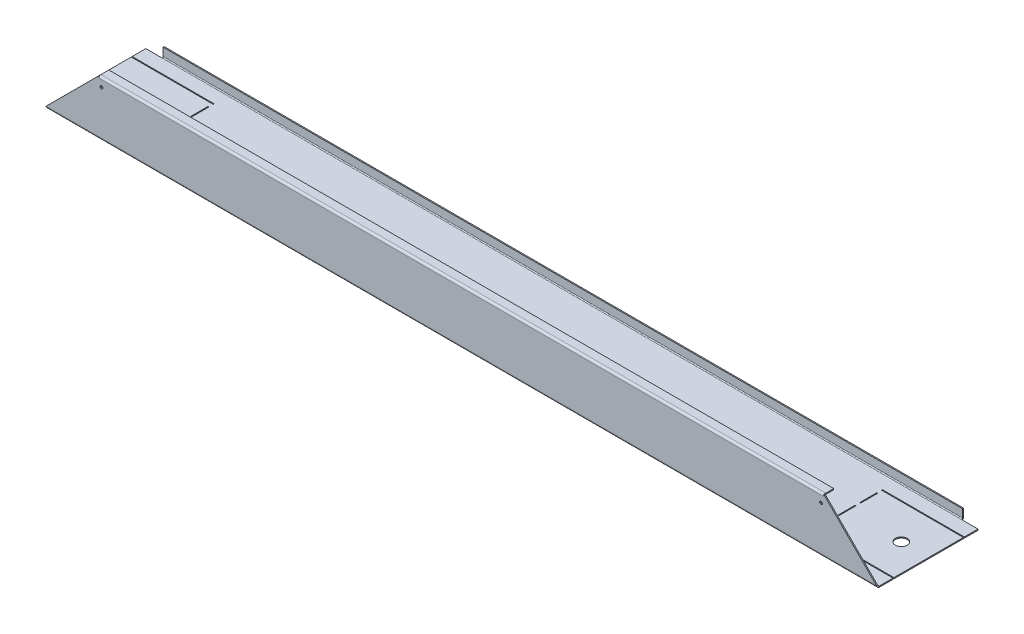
ISO-10303-21;
HEADER;
FILE_DESCRIPTION(('STEP AP214'),'2;1');
FILE_NAME('part.step','',(''),(''),'','','');
FILE_SCHEMA(('AUTOMOTIVE_DESIGN { 1 0 10303 214 1 1 1 1 }'));
ENDSEC;
DATA;
#1=APPLICATION_CONTEXT('core data for automotive mechanical design processes');
#2=APPLICATION_PROTOCOL_DEFINITION('international standard','automotive_design',2000,#1);
#3=PRODUCT_CONTEXT('',#1,'mechanical');
#4=PRODUCT('Part','Part','',(#3));
#5=PRODUCT_RELATED_PRODUCT_CATEGORY('part','',(#4));
#6=PRODUCT_DEFINITION_FORMATION('','',#4);
#7=PRODUCT_DEFINITION_CONTEXT('part definition',#1,'design');
#8=PRODUCT_DEFINITION('design','',#6,#7);
#9=PRODUCT_DEFINITION_SHAPE('','',#8);
#10=(LENGTH_UNIT() NAMED_UNIT(*) SI_UNIT(.MILLI.,.METRE.));
#11=(NAMED_UNIT(*) PLANE_ANGLE_UNIT() SI_UNIT($,.RADIAN.));
#12=(NAMED_UNIT(*) SI_UNIT($,.STERADIAN.) SOLID_ANGLE_UNIT());
#13=UNCERTAINTY_MEASURE_WITH_UNIT(LENGTH_MEASURE(1.E-05),#10,'distance_accuracy_value','');
#14=(GEOMETRIC_REPRESENTATION_CONTEXT(3) GLOBAL_UNCERTAINTY_ASSIGNED_CONTEXT((#13)) GLOBAL_UNIT_ASSIGNED_CONTEXT((#10,
#11,#12)) REPRESENTATION_CONTEXT('',''));
#15=CARTESIAN_POINT('',(0.,0.,0.));
#16=DIRECTION('',(0.,0.,1.));
#17=DIRECTION('',(1.,0.,0.));
#18=AXIS2_PLACEMENT_3D('',#15,#16,#17);
#19=CARTESIAN_POINT('',(-438.3,-1009.2,-109.200000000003));
#20=DIRECTION('',(1.,0.,0.));
#21=DIRECTION('',(0.,0.,-1.));
#22=AXIS2_PLACEMENT_3D('',#19,#20,#21);
#23=PLANE('',#22);
#24=DIRECTION('',(0.,-1.,0.));
#25=VECTOR('',#24,1.);
#26=CARTESIAN_POINT('',(-438.3,-1009.2,-111.400000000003));
#27=LINE('',#26,#25);
#28=CARTESIAN_POINT('',(-438.3,-1009.2,-111.400000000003));
#29=VERTEX_POINT('',#28);
#30=CARTESIAN_POINT('',(-438.3,-1018.,-111.400000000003));
#31=VERTEX_POINT('',#30);
#32=EDGE_CURVE('E507',#29,#31,#27,.T.);
#33=ORIENTED_EDGE('',*,*,#32,.T.);
#34=DIRECTION('',(0.,0.,1.));
#35=VECTOR('',#34,1.);
#36=CARTESIAN_POINT('',(-438.3,-1018.,-111.400000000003));
#37=LINE('',#36,#35);
#38=CARTESIAN_POINT('',(-438.3,-1018.,-110.200000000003));
#39=VERTEX_POINT('',#38);
#40=EDGE_CURVE('E13',#31,#39,#37,.T.);
#41=ORIENTED_EDGE('',*,*,#40,.T.);
#42=DIRECTION('',(0.,-1.,0.));
#43=VECTOR('',#42,1.);
#44=CARTESIAN_POINT('',(-438.3,0.,-110.200000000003));
#45=LINE('',#44,#43);
#46=CARTESIAN_POINT('',(-438.3,-1009.2,-110.200000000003));
#47=VERTEX_POINT('',#46);
#48=EDGE_CURVE('E125',#47,#39,#45,.T.);
#49=ORIENTED_EDGE('',*,*,#48,.F.);
#50=DIRECTION('',(0.,0.,-1.));
#51=VECTOR('',#50,1.);
#52=CARTESIAN_POINT('',(-438.3,-1009.2,-111.400000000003));
#53=LINE('',#52,#51);
#54=EDGE_CURVE('E111',#47,#29,#53,.T.);
#55=ORIENTED_EDGE('',*,*,#54,.T.);
#56=EDGE_LOOP('',(#33,#41,#49,#55));
#57=FACE_BOUND('',#56,.T.);
#58=ADVANCED_FACE('F103',(#57),#23,.F.);
#59=CARTESIAN_POINT('',(-456.3,-1020.2,1.72024273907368E-13));
#60=DIRECTION('',(-1.,0.,0.));
#61=DIRECTION('',(0.,0.,1.));
#62=AXIS2_PLACEMENT_3D('',#59,#60,#61);
#63=PLANE('',#62);
#64=DIRECTION('',(0.,-1.,0.));
#65=VECTOR('',#64,1.);
#66=CARTESIAN_POINT('',(-456.3,-960.198999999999,-94.2000000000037));
#67=LINE('',#66,#65);
#68=CARTESIAN_POINT('',(-456.3,-1019.,-94.2000000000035));
#69=VERTEX_POINT('',#68);
#70=CARTESIAN_POINT('',(-456.3,-1020.2,-94.2000000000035));
#71=VERTEX_POINT('',#70);
#72=EDGE_CURVE('E1087',#69,#71,#67,.T.);
#73=ORIENTED_EDGE('',*,*,#72,.F.);
#74=DIRECTION('',(0.,0.,-1.));
#75=VECTOR('',#74,1.);
#76=CARTESIAN_POINT('',(-456.3,-1019.,4.06696420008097E-12));
#77=LINE('',#76,#75);
#78=CARTESIAN_POINT('',(-456.3,-1019.,-109.200000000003));
#79=VERTEX_POINT('',#78);
#80=EDGE_CURVE('E545',#79,#69,#77,.F.);
#81=ORIENTED_EDGE('',*,*,#80,.F.);
#82=DIRECTION('',(0.,-1.,0.));
#83=VECTOR('',#82,1.);
#84=CARTESIAN_POINT('',(-456.3,-1019.,-109.200000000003));
#85=LINE('',#84,#83);
#86=CARTESIAN_POINT('',(-456.3,-1020.2,-109.200000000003));
#87=VERTEX_POINT('',#86);
#88=EDGE_CURVE('E524',#79,#87,#85,.T.);
#89=ORIENTED_EDGE('',*,*,#88,.T.);
#90=DIRECTION('',(0.,0.,1.));
#91=VECTOR('',#90,1.);
#92=CARTESIAN_POINT('',(-456.3,-1020.2,1.72024273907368E-13));
#93=LINE('',#92,#91);
#94=EDGE_CURVE('E523',#87,#71,#93,.T.);
#95=ORIENTED_EDGE('',*,*,#94,.T.);
#96=EDGE_LOOP('',(#73,#81,#89,#95));
#97=FACE_BOUND('',#96,.T.);
#98=ADVANCED_FACE('F701',(#97),#63,.T.);
#99=DIRECTION('',(0.,-1.,0.));
#100=VECTOR('',#99,1.);
#101=CARTESIAN_POINT('',(-456.3,-960.198999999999,-16.0000000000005));
#102=LINE('',#101,#100);
#103=CARTESIAN_POINT('',(-456.3,-1019.,-16.0000000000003));
#104=VERTEX_POINT('',#103);
#105=CARTESIAN_POINT('',(-456.3,-1020.2,-16.0000000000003));
#106=VERTEX_POINT('',#105);
#107=EDGE_CURVE('E925',#104,#106,#102,.T.);
#108=ORIENTED_EDGE('',*,*,#107,.T.);
#109=CARTESIAN_POINT('',(-456.3,-1020.2,-0.999999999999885));
#110=VERTEX_POINT('',#109);
#111=EDGE_CURVE('E539',#106,#110,#93,.T.);
#112=ORIENTED_EDGE('',*,*,#111,.T.);
#113=DIRECTION('',(0.,-1.,0.));
#114=VECTOR('',#113,1.);
#115=CARTESIAN_POINT('',(-456.3,-1019.,-0.99999999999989));
#116=LINE('',#115,#114);
#117=CARTESIAN_POINT('',(-456.3,-1019.,-0.99999999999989));
#118=VERTEX_POINT('',#117);
#119=EDGE_CURVE('E558',#118,#110,#116,.T.);
#120=ORIENTED_EDGE('',*,*,#119,.F.);
#121=EDGE_CURVE('E549',#104,#118,#77,.F.);
#122=ORIENTED_EDGE('',*,*,#121,.F.);
#123=EDGE_LOOP('',(#108,#112,#120,#122));
#124=FACE_BOUND('',#123,.T.);
#125=ADVANCED_FACE('F706',(#124),#63,.T.);
#126=CARTESIAN_POINT('',(456.299999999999,-1020.2,-111.400000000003));
#127=DIRECTION('',(1.,0.,0.));
#128=DIRECTION('',(0.,0.,-1.));
#129=AXIS2_PLACEMENT_3D('',#126,#127,#128);
#130=PLANE('',#129);
#131=DIRECTION('',(0.,-1.,0.));
#132=VECTOR('',#131,1.);
#133=CARTESIAN_POINT('',(456.3,-960.198999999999,-16.0000000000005));
#134=LINE('',#133,#132);
#135=CARTESIAN_POINT('',(456.3,-1019.,-16.0000000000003));
#136=VERTEX_POINT('',#135);
#137=CARTESIAN_POINT('',(456.3,-1020.2,-16.0000000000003));
#138=VERTEX_POINT('',#137);
#139=EDGE_CURVE('E1256',#136,#138,#134,.T.);
#140=ORIENTED_EDGE('',*,*,#139,.F.);
#141=DIRECTION('',(0.,0.,1.));
#142=VECTOR('',#141,1.);
#143=CARTESIAN_POINT('',(456.299999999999,-1019.,4.06696420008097E-12));
#144=LINE('',#143,#142);
#145=CARTESIAN_POINT('',(456.299999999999,-1019.,-0.99999999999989));
#146=VERTEX_POINT('',#145);
#147=EDGE_CURVE('E550',#146,#136,#144,.F.);
#148=ORIENTED_EDGE('',*,*,#147,.F.);
#149=DIRECTION('',(0.,-1.,0.));
#150=VECTOR('',#149,1.);
#151=CARTESIAN_POINT('',(456.299999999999,-1020.2,-0.99999999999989));
#152=LINE('',#151,#150);
#153=CARTESIAN_POINT('',(456.299999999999,-1020.2,-0.999999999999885));
#154=VERTEX_POINT('',#153);
#155=EDGE_CURVE('E534',#146,#154,#152,.T.);
#156=ORIENTED_EDGE('',*,*,#155,.T.);
#157=DIRECTION('',(0.,0.,-1.));
#158=VECTOR('',#157,1.);
#159=CARTESIAN_POINT('',(456.299999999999,-1020.2,-111.400000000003));
#160=LINE('',#159,#158);
#161=EDGE_CURVE('E540',#154,#138,#160,.T.);
#162=ORIENTED_EDGE('',*,*,#161,.T.);
#163=EDGE_LOOP('',(#140,#148,#156,#162));
#164=FACE_BOUND('',#163,.T.);
#165=ADVANCED_FACE('F914',(#164),#130,.T.);
#166=DIRECTION('',(0.,-1.,0.));
#167=VECTOR('',#166,1.);
#168=CARTESIAN_POINT('',(456.3,-960.198999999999,-94.2000000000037));
#169=LINE('',#168,#167);
#170=CARTESIAN_POINT('',(456.3,-1019.,-94.2000000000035));
#171=VERTEX_POINT('',#170);
#172=CARTESIAN_POINT('',(456.3,-1020.2,-94.2000000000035));
#173=VERTEX_POINT('',#172);
#174=EDGE_CURVE('E1174',#171,#173,#169,.T.);
#175=ORIENTED_EDGE('',*,*,#174,.T.);
#176=CARTESIAN_POINT('',(456.3,-1020.2,-109.200000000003));
#177=VERTEX_POINT('',#176);
#178=EDGE_CURVE('E544',#173,#177,#160,.T.);
#179=ORIENTED_EDGE('',*,*,#178,.T.);
#180=DIRECTION('',(0.,-1.,0.));
#181=VECTOR('',#180,1.);
#182=CARTESIAN_POINT('',(456.299999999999,-1019.,-109.200000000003));
#183=LINE('',#182,#181);
#184=CARTESIAN_POINT('',(456.3,-1019.,-109.200000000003));
#185=VERTEX_POINT('',#184);
#186=EDGE_CURVE('E525',#185,#177,#183,.T.);
#187=ORIENTED_EDGE('',*,*,#186,.F.);
#188=EDGE_CURVE('E554',#171,#185,#144,.F.);
#189=ORIENTED_EDGE('',*,*,#188,.F.);
#190=EDGE_LOOP('',(#175,#179,#187,#189));
#191=FACE_BOUND('',#190,.T.);
#192=ADVANCED_FACE('F909',(#191),#130,.T.);
#193=DIRECTION('',(0.,-1.,0.));
#194=VECTOR('',#193,1.);
#195=CARTESIAN_POINT('',(-456.3,-960.198999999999,-93.2000000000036));
#196=LINE('',#195,#194);
#197=CARTESIAN_POINT('',(-456.3,-1019.,-93.2000000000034));
#198=VERTEX_POINT('',#197);
#199=CARTESIAN_POINT('',(-456.3,-1020.2,-93.2000000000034));
#200=VERTEX_POINT('',#199);
#201=EDGE_CURVE('E944',#198,#200,#196,.T.);
#202=ORIENTED_EDGE('',*,*,#201,.T.);
#203=CARTESIAN_POINT('',(-456.3,-1020.2,-17.0000000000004));
#204=VERTEX_POINT('',#203);
#205=EDGE_CURVE('E538',#200,#204,#93,.T.);
#206=ORIENTED_EDGE('',*,*,#205,.T.);
#207=DIRECTION('',(0.,-1.,0.));
#208=VECTOR('',#207,1.);
#209=CARTESIAN_POINT('',(-456.3,-960.198999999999,-17.0000000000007));
#210=LINE('',#209,#208);
#211=CARTESIAN_POINT('',(-456.3,-1019.,-17.0000000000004));
#212=VERTEX_POINT('',#211);
#213=EDGE_CURVE('E942',#212,#204,#210,.T.);
#214=ORIENTED_EDGE('',*,*,#213,.F.);
#215=EDGE_CURVE('E548',#198,#212,#77,.F.);
#216=ORIENTED_EDGE('',*,*,#215,.F.);
#217=EDGE_LOOP('',(#202,#206,#214,#216));
#218=FACE_BOUND('',#217,.T.);
#219=ADVANCED_FACE('F708',(#218),#63,.T.);
#220=CARTESIAN_POINT('',(0.,-1020.2,4.07115397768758E-12));
#221=DIRECTION('',(0.,-1.,0.));
#222=DIRECTION('',(0.,0.,-1.));
#223=AXIS2_PLACEMENT_3D('',#220,#221,#222);
#224=PLANE('',#223);
#225=DIRECTION('',(-1.,0.,0.));
#226=VECTOR('',#225,1.);
#227=CARTESIAN_POINT('',(456.3,-1020.2,-16.0000000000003));
#228=LINE('',#227,#226);
#229=CARTESIAN_POINT('',(366.3,-1020.2,-16.0000000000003));
#230=VERTEX_POINT('',#229);
#231=EDGE_CURVE('E1247',#138,#230,#228,.T.);
#232=ORIENTED_EDGE('',*,*,#231,.F.);
#233=ORIENTED_EDGE('',*,*,#161,.F.);
#234=DIRECTION('',(-1.,0.,0.));
#235=VECTOR('',#234,1.);
#236=CARTESIAN_POINT('',(0.,-1020.2,-0.999999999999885));
#237=LINE('',#236,#235);
#238=EDGE_CURVE('E555',#154,#110,#237,.T.);
#239=ORIENTED_EDGE('',*,*,#238,.T.);
#240=ORIENTED_EDGE('',*,*,#111,.F.);
#241=DIRECTION('',(-1.,0.,0.));
#242=VECTOR('',#241,1.);
#243=CARTESIAN_POINT('',(-456.3,-1020.2,-16.0000000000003));
#244=LINE('',#243,#242);
#245=CARTESIAN_POINT('',(-366.3,-1020.2,-16.0000000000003));
#246=VERTEX_POINT('',#245);
#247=EDGE_CURVE('E936',#246,#106,#244,.T.);
#248=ORIENTED_EDGE('',*,*,#247,.F.);
#249=DIRECTION('',(0.,0.,1.));
#250=VECTOR('',#249,1.);
#251=CARTESIAN_POINT('',(-366.3,-1020.2,-16.0000000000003));
#252=LINE('',#251,#250);
#253=CARTESIAN_POINT('',(-366.3,-1020.2,-17.0000000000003));
#254=VERTEX_POINT('',#253);
#255=EDGE_CURVE('E952',#254,#246,#252,.T.);
#256=ORIENTED_EDGE('',*,*,#255,.F.);
#257=DIRECTION('',(1.,0.,0.));
#258=VECTOR('',#257,1.);
#259=CARTESIAN_POINT('',(-456.3,-1020.2,-17.0000000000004));
#260=LINE('',#259,#258);
#261=EDGE_CURVE('E950',#204,#254,#260,.T.);
#262=ORIENTED_EDGE('',*,*,#261,.F.);
#263=ORIENTED_EDGE('',*,*,#205,.F.);
#264=DIRECTION('',(-1.,0.,0.));
#265=VECTOR('',#264,1.);
#266=CARTESIAN_POINT('',(-456.3,-1020.2,-93.2000000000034));
#267=LINE('',#266,#265);
#268=CARTESIAN_POINT('',(-366.3,-1020.2,-93.2000000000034));
#269=VERTEX_POINT('',#268);
#270=EDGE_CURVE('E948',#269,#200,#267,.T.);
#271=ORIENTED_EDGE('',*,*,#270,.F.);
#272=DIRECTION('',(0.,0.,1.));
#273=VECTOR('',#272,1.);
#274=CARTESIAN_POINT('',(-366.3,-1020.2,-94.2000000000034));
#275=LINE('',#274,#273);
#276=CARTESIAN_POINT('',(-366.3,-1020.2,-94.2000000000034));
#277=VERTEX_POINT('',#276);
#278=EDGE_CURVE('E1082',#277,#269,#275,.T.);
#279=ORIENTED_EDGE('',*,*,#278,.F.);
#280=DIRECTION('',(1.,0.,0.));
#281=VECTOR('',#280,1.);
#282=CARTESIAN_POINT('',(-456.3,-1020.2,-94.2000000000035));
#283=LINE('',#282,#281);
#284=EDGE_CURVE('E1079',#71,#277,#283,.T.);
#285=ORIENTED_EDGE('',*,*,#284,.F.);
#286=ORIENTED_EDGE('',*,*,#94,.F.);
#287=DIRECTION('',(-1.,0.,0.));
#288=VECTOR('',#287,1.);
#289=CARTESIAN_POINT('',(-456.3,-1020.2,-109.200000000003));
#290=LINE('',#289,#288);
#291=CARTESIAN_POINT('',(-438.3,-1020.2,-109.200000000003));
#292=VERTEX_POINT('',#291);
#293=EDGE_CURVE('E502',#87,#292,#290,.F.);
#294=ORIENTED_EDGE('',*,*,#293,.T.);
#295=CARTESIAN_POINT('',(438.3,-1020.2,-109.200000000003));
#296=VERTEX_POINT('',#295);
#297=EDGE_CURVE('E511',#292,#296,#290,.F.);
#298=ORIENTED_EDGE('',*,*,#297,.T.);
#299=DIRECTION('',(-1.,0.,0.));
#300=VECTOR('',#299,1.);
#301=CARTESIAN_POINT('',(438.3,-1020.2,-109.200000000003));
#302=LINE('',#301,#300);
#303=EDGE_CURVE('E1367',#177,#296,#302,.T.);
#304=ORIENTED_EDGE('',*,*,#303,.F.);
#305=ORIENTED_EDGE('',*,*,#178,.F.);
#306=DIRECTION('',(1.,0.,0.));
#307=VECTOR('',#306,1.);
#308=CARTESIAN_POINT('',(456.3,-1020.2,-94.2000000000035));
#309=LINE('',#308,#307);
#310=CARTESIAN_POINT('',(366.3,-1020.2,-94.2000000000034));
#311=VERTEX_POINT('',#310);
#312=EDGE_CURVE('E1171',#311,#173,#309,.T.);
#313=ORIENTED_EDGE('',*,*,#312,.F.);
#314=DIRECTION('',(0.,0.,-1.));
#315=VECTOR('',#314,1.);
#316=CARTESIAN_POINT('',(366.3,-1020.2,-94.2000000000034));
#317=LINE('',#316,#315);
#318=CARTESIAN_POINT('',(366.3,-1020.2,-93.2000000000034));
#319=VERTEX_POINT('',#318);
#320=EDGE_CURVE('E1168',#319,#311,#317,.T.);
#321=ORIENTED_EDGE('',*,*,#320,.F.);
#322=DIRECTION('',(-1.,0.,0.));
#323=VECTOR('',#322,1.);
#324=CARTESIAN_POINT('',(456.3,-1020.2,-93.2000000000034));
#325=LINE('',#324,#323);
#326=CARTESIAN_POINT('',(456.3,-1020.2,-93.2000000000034));
#327=VERTEX_POINT('',#326);
#328=EDGE_CURVE('E1165',#327,#319,#325,.T.);
#329=ORIENTED_EDGE('',*,*,#328,.F.);
#330=CARTESIAN_POINT('',(456.299999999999,-1020.2,-17.0000000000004));
#331=VERTEX_POINT('',#330);
#332=EDGE_CURVE('E543',#331,#327,#160,.T.);
#333=ORIENTED_EDGE('',*,*,#332,.F.);
#334=DIRECTION('',(1.,0.,0.));
#335=VECTOR('',#334,1.);
#336=CARTESIAN_POINT('',(456.3,-1020.2,-17.0000000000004));
#337=LINE('',#336,#335);
#338=CARTESIAN_POINT('',(366.3,-1020.2,-17.0000000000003));
#339=VERTEX_POINT('',#338);
#340=EDGE_CURVE('E1253',#339,#331,#337,.T.);
#341=ORIENTED_EDGE('',*,*,#340,.F.);
#342=DIRECTION('',(0.,0.,-1.));
#343=VECTOR('',#342,1.);
#344=CARTESIAN_POINT('',(366.3,-1020.2,-16.0000000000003));
#345=LINE('',#344,#343);
#346=EDGE_CURVE('E1250',#230,#339,#345,.T.);
#347=ORIENTED_EDGE('',*,*,#346,.F.);
#348=EDGE_LOOP('',(#232,#233,#239,#240,#248,#256,#262,#263,#271,#279,#285,#286,#294,#298,#304,
#305,#313,#321,#329,#333,#341,#347));
#349=FACE_BOUND('',#348,.T.);
#350=DIRECTION('',(-1.,0.,0.));
#351=VECTOR('',#350,1.);
#352=CARTESIAN_POINT('',(367.3,-1020.2,-69.466666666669));
#353=LINE('',#352,#351);
#354=CARTESIAN_POINT('',(367.3,-1020.2,-69.466666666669));
#355=VERTEX_POINT('',#354);
#356=CARTESIAN_POINT('',(366.3,-1020.2,-69.466666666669));
#357=VERTEX_POINT('',#356);
#358=EDGE_CURVE('E1192',#355,#357,#353,.T.);
#359=ORIENTED_EDGE('',*,*,#358,.F.);
#360=DIRECTION('',(0.,0.,1.));
#361=VECTOR('',#360,1.);
#362=CARTESIAN_POINT('',(367.3,-1020.2,-69.466666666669));
#363=LINE('',#362,#361);
#364=CARTESIAN_POINT('',(367.3,-1020.2,-88.2000000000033));
#365=VERTEX_POINT('',#364);
#366=EDGE_CURVE('E1200',#365,#355,#363,.T.);
#367=ORIENTED_EDGE('',*,*,#366,.F.);
#368=DIRECTION('',(1.,0.,0.));
#369=VECTOR('',#368,1.);
#370=CARTESIAN_POINT('',(367.3,-1020.2,-88.2000000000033));
#371=LINE('',#370,#369);
#372=CARTESIAN_POINT('',(366.3,-1020.2,-88.2000000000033));
#373=VERTEX_POINT('',#372);
#374=EDGE_CURVE('E1197',#373,#365,#371,.T.);
#375=ORIENTED_EDGE('',*,*,#374,.F.);
#376=DIRECTION('',(0.,0.,-1.));
#377=VECTOR('',#376,1.);
#378=CARTESIAN_POINT('',(366.3,-1020.2,-69.466666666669));
#379=LINE('',#378,#377);
#380=EDGE_CURVE('E1194',#357,#373,#379,.T.);
#381=ORIENTED_EDGE('',*,*,#380,.F.);
#382=EDGE_LOOP('',(#359,#367,#375,#381));
#383=FACE_BOUND('',#382,.T.);
#384=DIRECTION('',(-1.,0.,0.));
#385=VECTOR('',#384,1.);
#386=CARTESIAN_POINT('',(367.3,-1020.2,-45.7333333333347));
#387=LINE('',#386,#385);
#388=CARTESIAN_POINT('',(367.3,-1020.2,-45.7333333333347));
#389=VERTEX_POINT('',#388);
#390=CARTESIAN_POINT('',(366.3,-1020.2,-45.7333333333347));
#391=VERTEX_POINT('',#390);
#392=EDGE_CURVE('E1221',#389,#391,#387,.T.);
#393=ORIENTED_EDGE('',*,*,#392,.F.);
#394=DIRECTION('',(0.,0.,1.));
#395=VECTOR('',#394,1.);
#396=CARTESIAN_POINT('',(367.3,-1020.2,-45.7333333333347));
#397=LINE('',#396,#395);
#398=CARTESIAN_POINT('',(367.3,-1020.2,-64.466666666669));
#399=VERTEX_POINT('',#398);
#400=EDGE_CURVE('E1229',#399,#389,#397,.T.);
#401=ORIENTED_EDGE('',*,*,#400,.F.);
#402=DIRECTION('',(1.,0.,0.));
#403=VECTOR('',#402,1.);
#404=CARTESIAN_POINT('',(367.3,-1020.2,-64.466666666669));
#405=LINE('',#404,#403);
#406=CARTESIAN_POINT('',(366.3,-1020.2,-64.466666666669));
#407=VERTEX_POINT('',#406);
#408=EDGE_CURVE('E1226',#407,#399,#405,.T.);
#409=ORIENTED_EDGE('',*,*,#408,.F.);
#410=DIRECTION('',(0.,0.,-1.));
#411=VECTOR('',#410,1.);
#412=CARTESIAN_POINT('',(366.3,-1020.2,-45.7333333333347));
#413=LINE('',#412,#411);
#414=EDGE_CURVE('E1223',#391,#407,#413,.T.);
#415=ORIENTED_EDGE('',*,*,#414,.F.);
#416=EDGE_LOOP('',(#393,#401,#409,#415));
#417=FACE_BOUND('',#416,.T.);
#418=DIRECTION('',(-1.,0.,0.));
#419=VECTOR('',#418,1.);
#420=CARTESIAN_POINT('',(367.3,-1020.2,-22.0000000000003));
#421=LINE('',#420,#419);
#422=CARTESIAN_POINT('',(367.3,-1020.2,-22.0000000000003));
#423=VERTEX_POINT('',#422);
#424=CARTESIAN_POINT('',(366.3,-1020.2,-22.0000000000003));
#425=VERTEX_POINT('',#424);
#426=EDGE_CURVE('E1134',#423,#425,#421,.T.);
#427=ORIENTED_EDGE('',*,*,#426,.F.);
#428=DIRECTION('',(0.,0.,1.));
#429=VECTOR('',#428,1.);
#430=CARTESIAN_POINT('',(367.3,-1020.2,-22.0000000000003));
#431=LINE('',#430,#429);
#432=CARTESIAN_POINT('',(367.3,-1020.2,-40.7333333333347));
#433=VERTEX_POINT('',#432);
#434=EDGE_CURVE('E1142',#433,#423,#431,.T.);
#435=ORIENTED_EDGE('',*,*,#434,.F.);
#436=DIRECTION('',(1.,0.,0.));
#437=VECTOR('',#436,1.);
#438=CARTESIAN_POINT('',(367.3,-1020.2,-40.7333333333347));
#439=LINE('',#438,#437);
#440=CARTESIAN_POINT('',(366.3,-1020.2,-40.7333333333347));
#441=VERTEX_POINT('',#440);
#442=EDGE_CURVE('E1139',#441,#433,#439,.T.);
#443=ORIENTED_EDGE('',*,*,#442,.F.);
#444=DIRECTION('',(0.,0.,-1.));
#445=VECTOR('',#444,1.);
#446=CARTESIAN_POINT('',(366.3,-1020.2,-22.0000000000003));
#447=LINE('',#446,#445);
#448=EDGE_CURVE('E1136',#425,#441,#447,.T.);
#449=ORIENTED_EDGE('',*,*,#448,.F.);
#450=EDGE_LOOP('',(#427,#435,#443,#449));
#451=FACE_BOUND('',#450,.T.);
#452=DIRECTION('',(0.,0.,-1.));
#453=VECTOR('',#452,1.);
#454=CARTESIAN_POINT('',(-367.3,-1020.2,-22.0000000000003));
#455=LINE('',#454,#453);
#456=CARTESIAN_POINT('',(-367.3,-1020.2,-22.0000000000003));
#457=VERTEX_POINT('',#456);
#458=CARTESIAN_POINT('',(-367.3,-1020.2,-40.7333333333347));
#459=VERTEX_POINT('',#458);
#460=EDGE_CURVE('E1103',#457,#459,#455,.T.);
#461=ORIENTED_EDGE('',*,*,#460,.F.);
#462=DIRECTION('',(-1.,0.,0.));
#463=VECTOR('',#462,1.);
#464=CARTESIAN_POINT('',(-367.3,-1020.2,-22.0000000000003));
#465=LINE('',#464,#463);
#466=CARTESIAN_POINT('',(-366.3,-1020.2,-22.0000000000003));
#467=VERTEX_POINT('',#466);
#468=EDGE_CURVE('E1111',#467,#457,#465,.T.);
#469=ORIENTED_EDGE('',*,*,#468,.F.);
#470=DIRECTION('',(0.,0.,1.));
#471=VECTOR('',#470,1.);
#472=CARTESIAN_POINT('',(-366.3,-1020.2,-22.0000000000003));
#473=LINE('',#472,#471);
#474=CARTESIAN_POINT('',(-366.3,-1020.2,-40.7333333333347));
#475=VERTEX_POINT('',#474);
#476=EDGE_CURVE('E1108',#475,#467,#473,.T.);
#477=ORIENTED_EDGE('',*,*,#476,.F.);
#478=DIRECTION('',(1.,0.,0.));
#479=VECTOR('',#478,1.);
#480=CARTESIAN_POINT('',(-367.3,-1020.2,-40.7333333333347));
#481=LINE('',#480,#479);
#482=EDGE_CURVE('E1105',#459,#475,#481,.T.);
#483=ORIENTED_EDGE('',*,*,#482,.F.);
#484=EDGE_LOOP('',(#461,#469,#477,#483));
#485=FACE_BOUND('',#484,.T.);
#486=DIRECTION('',(0.,0.,-1.));
#487=VECTOR('',#486,1.);
#488=CARTESIAN_POINT('',(-367.3,-1020.2,-45.7333333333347));
#489=LINE('',#488,#487);
#490=CARTESIAN_POINT('',(-367.3,-1020.2,-45.7333333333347));
#491=VERTEX_POINT('',#490);
#492=CARTESIAN_POINT('',(-367.3,-1020.2,-64.466666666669));
#493=VERTEX_POINT('',#492);
#494=EDGE_CURVE('E1019',#491,#493,#489,.T.);
#495=ORIENTED_EDGE('',*,*,#494,.F.);
#496=DIRECTION('',(-1.,0.,0.));
#497=VECTOR('',#496,1.);
#498=CARTESIAN_POINT('',(-367.3,-1020.2,-45.7333333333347));
#499=LINE('',#498,#497);
#500=CARTESIAN_POINT('',(-366.3,-1020.2,-45.7333333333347));
#501=VERTEX_POINT('',#500);
#502=EDGE_CURVE('E1027',#501,#491,#499,.T.);
#503=ORIENTED_EDGE('',*,*,#502,.F.);
#504=DIRECTION('',(0.,0.,1.));
#505=VECTOR('',#504,1.);
#506=CARTESIAN_POINT('',(-366.3,-1020.2,-45.7333333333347));
#507=LINE('',#506,#505);
#508=CARTESIAN_POINT('',(-366.3,-1020.2,-64.466666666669));
#509=VERTEX_POINT('',#508);
#510=EDGE_CURVE('E1024',#509,#501,#507,.T.);
#511=ORIENTED_EDGE('',*,*,#510,.F.);
#512=DIRECTION('',(1.,0.,0.));
#513=VECTOR('',#512,1.);
#514=CARTESIAN_POINT('',(-367.3,-1020.2,-64.466666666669));
#515=LINE('',#514,#513);
#516=EDGE_CURVE('E1021',#493,#509,#515,.T.);
#517=ORIENTED_EDGE('',*,*,#516,.F.);
#518=EDGE_LOOP('',(#495,#503,#511,#517));
#519=FACE_BOUND('',#518,.T.);
#520=DIRECTION('',(0.,0.,-1.));
#521=VECTOR('',#520,1.);
#522=CARTESIAN_POINT('',(-367.3,-1020.2,-69.466666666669));
#523=LINE('',#522,#521);
#524=CARTESIAN_POINT('',(-367.3,-1020.2,-69.466666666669));
#525=VERTEX_POINT('',#524);
#526=CARTESIAN_POINT('',(-367.3,-1020.2,-88.2000000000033));
#527=VERTEX_POINT('',#526);
#528=EDGE_CURVE('E1052',#525,#527,#523,.T.);
#529=ORIENTED_EDGE('',*,*,#528,.F.);
#530=DIRECTION('',(-1.,0.,0.));
#531=VECTOR('',#530,1.);
#532=CARTESIAN_POINT('',(-367.3,-1020.2,-69.466666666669));
#533=LINE('',#532,#531);
#534=CARTESIAN_POINT('',(-366.3,-1020.2,-69.466666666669));
#535=VERTEX_POINT('',#534);
#536=EDGE_CURVE('E1060',#535,#525,#533,.T.);
#537=ORIENTED_EDGE('',*,*,#536,.F.);
#538=DIRECTION('',(0.,0.,1.));
#539=VECTOR('',#538,1.);
#540=CARTESIAN_POINT('',(-366.3,-1020.2,-69.466666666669));
#541=LINE('',#540,#539);
#542=CARTESIAN_POINT('',(-366.3,-1020.2,-88.2000000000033));
#543=VERTEX_POINT('',#542);
#544=EDGE_CURVE('E1057',#543,#535,#541,.T.);
#545=ORIENTED_EDGE('',*,*,#544,.F.);
#546=DIRECTION('',(1.,0.,0.));
#547=VECTOR('',#546,1.);
#548=CARTESIAN_POINT('',(-367.3,-1020.2,-88.2000000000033));
#549=LINE('',#548,#547);
#550=EDGE_CURVE('E1054',#527,#543,#549,.T.);
#551=ORIENTED_EDGE('',*,*,#550,.F.);
#552=EDGE_LOOP('',(#529,#537,#545,#551));
#553=FACE_BOUND('',#552,.T.);
#554=CARTESIAN_POINT('',(-426.300000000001,-1020.2,-55.1000000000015));
#555=DIRECTION('',(0.,-1.,0.));
#556=DIRECTION('',(0.,0.,-1.));
#557=AXIS2_PLACEMENT_3D('',#554,#555,#556);
#558=CIRCLE('',#557,6.50000000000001);
#559=CARTESIAN_POINT('',(-426.300000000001,-1020.2,-61.6000000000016));
#560=VERTEX_POINT('',#559);
#561=EDGE_CURVE('E972',#560,#560,#558,.T.);
#562=ORIENTED_EDGE('',*,*,#561,.F.);
#563=EDGE_LOOP('',(#562));
#564=FACE_BOUND('',#563,.T.);
#565=CARTESIAN_POINT('',(426.299999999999,-1020.2,-55.0999999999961));
#566=DIRECTION('',(0.,-1.,0.));
#567=DIRECTION('',(0.,0.,-1.));
#568=AXIS2_PLACEMENT_3D('',#565,#566,#567);
#569=CIRCLE('',#568,6.50000000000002);
#570=CARTESIAN_POINT('',(426.299999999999,-1020.2,-61.5999999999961));
#571=VERTEX_POINT('',#570);
#572=EDGE_CURVE('E967',#571,#571,#569,.T.);
#573=ORIENTED_EDGE('',*,*,#572,.F.);
#574=EDGE_LOOP('',(#573));
#575=FACE_BOUND('',#574,.T.);
#576=ADVANCED_FACE('F519',(#349,#383,#417,#451,#485,#519,#553,#564,#575),#224,.T.);
#577=CARTESIAN_POINT('',(0.,-1019.,4.06696420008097E-12));
#578=DIRECTION('',(0.,-1.,0.));
#579=DIRECTION('',(0.,0.,-1.));
#580=AXIS2_PLACEMENT_3D('',#577,#578,#579);
#581=PLANE('',#580);
#582=ORIENTED_EDGE('',*,*,#147,.T.);
#583=DIRECTION('',(1.,0.,0.));
#584=VECTOR('',#583,1.);
#585=CARTESIAN_POINT('',(456.3,-1019.,-16.0000000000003));
#586=LINE('',#585,#584);
#587=CARTESIAN_POINT('',(366.3,-1019.,-16.0000000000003));
#588=VERTEX_POINT('',#587);
#589=EDGE_CURVE('E1245',#588,#136,#586,.T.);
#590=ORIENTED_EDGE('',*,*,#589,.F.);
#591=DIRECTION('',(0.,0.,1.));
#592=VECTOR('',#591,1.);
#593=CARTESIAN_POINT('',(366.3,-1019.,-16.0000000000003));
#594=LINE('',#593,#592);
#595=CARTESIAN_POINT('',(366.3,-1019.,-17.0000000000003));
#596=VERTEX_POINT('',#595);
#597=EDGE_CURVE('E1162',#596,#588,#594,.T.);
#598=ORIENTED_EDGE('',*,*,#597,.F.);
#599=DIRECTION('',(-1.,0.,0.));
#600=VECTOR('',#599,1.);
#601=CARTESIAN_POINT('',(456.3,-1019.,-17.0000000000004));
#602=LINE('',#601,#600);
#603=CARTESIAN_POINT('',(456.3,-1019.,-17.0000000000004));
#604=VERTEX_POINT('',#603);
#605=EDGE_CURVE('E496',#604,#596,#602,.T.);
#606=ORIENTED_EDGE('',*,*,#605,.F.);
#607=CARTESIAN_POINT('',(456.299999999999,-1019.,-93.2000000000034));
#608=VERTEX_POINT('',#607);
#609=EDGE_CURVE('E553',#604,#608,#144,.F.);
#610=ORIENTED_EDGE('',*,*,#609,.T.);
#611=DIRECTION('',(1.,0.,0.));
#612=VECTOR('',#611,1.);
#613=CARTESIAN_POINT('',(456.3,-1019.,-93.2000000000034));
#614=LINE('',#613,#612);
#615=CARTESIAN_POINT('',(366.3,-1019.,-93.2000000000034));
#616=VERTEX_POINT('',#615);
#617=EDGE_CURVE('E1128',#616,#608,#614,.T.);
#618=ORIENTED_EDGE('',*,*,#617,.F.);
#619=DIRECTION('',(0.,0.,1.));
#620=VECTOR('',#619,1.);
#621=CARTESIAN_POINT('',(366.3,-1019.,-94.2000000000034));
#622=LINE('',#621,#620);
#623=CARTESIAN_POINT('',(366.3,-1019.,-94.2000000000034));
#624=VERTEX_POINT('',#623);
#625=EDGE_CURVE('E1158',#624,#616,#622,.T.);
#626=ORIENTED_EDGE('',*,*,#625,.F.);
#627=DIRECTION('',(-1.,0.,0.));
#628=VECTOR('',#627,1.);
#629=CARTESIAN_POINT('',(456.3,-1019.,-94.2000000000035));
#630=LINE('',#629,#628);
#631=EDGE_CURVE('E1161',#171,#624,#630,.T.);
#632=ORIENTED_EDGE('',*,*,#631,.F.);
#633=ORIENTED_EDGE('',*,*,#188,.T.);
#634=DIRECTION('',(-1.,0.,0.));
#635=VECTOR('',#634,1.);
#636=CARTESIAN_POINT('',(-456.3,-1019.,-109.200000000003));
#637=LINE('',#636,#635);
#638=CARTESIAN_POINT('',(438.3,-1019.,-109.200000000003));
#639=VERTEX_POINT('',#638);
#640=EDGE_CURVE('E533',#639,#185,#637,.F.);
#641=ORIENTED_EDGE('',*,*,#640,.F.);
#642=CARTESIAN_POINT('',(-438.3,-1019.,-109.200000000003));
#643=VERTEX_POINT('',#642);
#644=EDGE_CURVE('E532',#643,#639,#637,.F.);
#645=ORIENTED_EDGE('',*,*,#644,.F.);
#646=EDGE_CURVE('E505',#79,#643,#637,.F.);
#647=ORIENTED_EDGE('',*,*,#646,.F.);
#648=ORIENTED_EDGE('',*,*,#80,.T.);
#649=DIRECTION('',(-1.,0.,0.));
#650=VECTOR('',#649,1.);
#651=CARTESIAN_POINT('',(-456.3,-1019.,-94.2000000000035));
#652=LINE('',#651,#650);
#653=CARTESIAN_POINT('',(-366.3,-1019.,-94.2000000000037));
#654=VERTEX_POINT('',#653);
#655=EDGE_CURVE('E1076',#654,#69,#652,.T.);
#656=ORIENTED_EDGE('',*,*,#655,.F.);
#657=DIRECTION('',(0.,0.,-1.));
#658=VECTOR('',#657,1.);
#659=CARTESIAN_POINT('',(-366.3,-1019.,-94.2000000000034));
#660=LINE('',#659,#658);
#661=CARTESIAN_POINT('',(-366.3,-1019.,-93.2000000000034));
#662=VERTEX_POINT('',#661);
#663=EDGE_CURVE('E1089',#662,#654,#660,.T.);
#664=ORIENTED_EDGE('',*,*,#663,.F.);
#665=DIRECTION('',(1.,0.,0.));
#666=VECTOR('',#665,1.);
#667=CARTESIAN_POINT('',(-456.3,-1019.,-93.2000000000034));
#668=LINE('',#667,#666);
#669=EDGE_CURVE('E1074',#198,#662,#668,.T.);
#670=ORIENTED_EDGE('',*,*,#669,.F.);
#671=ORIENTED_EDGE('',*,*,#215,.T.);
#672=DIRECTION('',(-1.,0.,0.));
#673=VECTOR('',#672,1.);
#674=CARTESIAN_POINT('',(-456.3,-1019.,-17.0000000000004));
#675=LINE('',#674,#673);
#676=CARTESIAN_POINT('',(-366.3,-1019.,-17.0000000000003));
#677=VERTEX_POINT('',#676);
#678=EDGE_CURVE('E931',#677,#212,#675,.T.);
#679=ORIENTED_EDGE('',*,*,#678,.F.);
#680=DIRECTION('',(0.,0.,-1.));
#681=VECTOR('',#680,1.);
#682=CARTESIAN_POINT('',(-366.3,-1019.,-16.0000000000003));
#683=LINE('',#682,#681);
#684=CARTESIAN_POINT('',(-366.3,-1019.,-16.0000000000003));
#685=VERTEX_POINT('',#684);
#686=EDGE_CURVE('E957',#685,#677,#683,.T.);
#687=ORIENTED_EDGE('',*,*,#686,.F.);
#688=DIRECTION('',(1.,0.,0.));
#689=VECTOR('',#688,1.);
#690=CARTESIAN_POINT('',(-456.3,-1019.,-16.0000000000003));
#691=LINE('',#690,#689);
#692=EDGE_CURVE('E954',#104,#685,#691,.T.);
#693=ORIENTED_EDGE('',*,*,#692,.F.);
#694=ORIENTED_EDGE('',*,*,#121,.T.);
#695=DIRECTION('',(1.,0.,0.));
#696=VECTOR('',#695,1.);
#697=CARTESIAN_POINT('',(456.299999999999,-1019.,-0.99999999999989));
#698=LINE('',#697,#696);
#699=EDGE_CURVE('E561',#146,#118,#698,.F.);
#700=ORIENTED_EDGE('',*,*,#699,.F.);
#701=EDGE_LOOP('',(#582,#590,#598,#606,#610,#618,#626,#632,#633,#641,#645,#647,#648,#656,#664,
#670,#671,#679,#687,#693,#694,#700));
#702=FACE_BOUND('',#701,.T.);
#703=DIRECTION('',(0.,0.,-1.));
#704=VECTOR('',#703,1.);
#705=CARTESIAN_POINT('',(367.3,-1019.,-69.466666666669));
#706=LINE('',#705,#704);
#707=CARTESIAN_POINT('',(367.3,-1019.,-69.466666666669));
#708=VERTEX_POINT('',#707);
#709=CARTESIAN_POINT('',(367.3,-1019.,-88.2000000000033));
#710=VERTEX_POINT('',#709);
#711=EDGE_CURVE('E1185',#708,#710,#706,.T.);
#712=ORIENTED_EDGE('',*,*,#711,.F.);
#713=DIRECTION('',(1.,0.,0.));
#714=VECTOR('',#713,1.);
#715=CARTESIAN_POINT('',(367.3,-1019.,-69.466666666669));
#716=LINE('',#715,#714);
#717=CARTESIAN_POINT('',(366.3,-1019.,-69.466666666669));
#718=VERTEX_POINT('',#717);
#719=EDGE_CURVE('E1189',#718,#708,#716,.T.);
#720=ORIENTED_EDGE('',*,*,#719,.F.);
#721=DIRECTION('',(0.,0.,1.));
#722=VECTOR('',#721,1.);
#723=CARTESIAN_POINT('',(366.3,-1019.,-69.466666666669));
#724=LINE('',#723,#722);
#725=CARTESIAN_POINT('',(366.3,-1019.,-88.2000000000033));
#726=VERTEX_POINT('',#725);
#727=EDGE_CURVE('E1046',#726,#718,#724,.T.);
#728=ORIENTED_EDGE('',*,*,#727,.F.);
#729=DIRECTION('',(-1.,0.,0.));
#730=VECTOR('',#729,1.);
#731=CARTESIAN_POINT('',(367.3,-1019.,-88.2000000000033));
#732=LINE('',#731,#730);
#733=EDGE_CURVE('E1183',#710,#726,#732,.T.);
#734=ORIENTED_EDGE('',*,*,#733,.F.);
#735=EDGE_LOOP('',(#712,#720,#728,#734));
#736=FACE_BOUND('',#735,.T.);
#737=DIRECTION('',(0.,0.,-1.));
#738=VECTOR('',#737,1.);
#739=CARTESIAN_POINT('',(367.3,-1019.,-45.7333333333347));
#740=LINE('',#739,#738);
#741=CARTESIAN_POINT('',(367.3,-1019.,-45.7333333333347));
#742=VERTEX_POINT('',#741);
#743=CARTESIAN_POINT('',(367.3,-1019.,-64.466666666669));
#744=VERTEX_POINT('',#743);
#745=EDGE_CURVE('E1215',#742,#744,#740,.T.);
#746=ORIENTED_EDGE('',*,*,#745,.F.);
#747=DIRECTION('',(1.,0.,0.));
#748=VECTOR('',#747,1.);
#749=CARTESIAN_POINT('',(367.3,-1019.,-45.7333333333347));
#750=LINE('',#749,#748);
#751=CARTESIAN_POINT('',(366.3,-1019.,-45.7333333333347));
#752=VERTEX_POINT('',#751);
#753=EDGE_CURVE('E1218',#752,#742,#750,.T.);
#754=ORIENTED_EDGE('',*,*,#753,.F.);
#755=DIRECTION('',(0.,0.,1.));
#756=VECTOR('',#755,1.);
#757=CARTESIAN_POINT('',(366.3,-1019.,-45.7333333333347));
#758=LINE('',#757,#756);
#759=CARTESIAN_POINT('',(366.3,-1019.,-64.466666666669));
#760=VERTEX_POINT('',#759);
#761=EDGE_CURVE('E1186',#760,#752,#758,.T.);
#762=ORIENTED_EDGE('',*,*,#761,.F.);
#763=DIRECTION('',(-1.,0.,0.));
#764=VECTOR('',#763,1.);
#765=CARTESIAN_POINT('',(367.3,-1019.,-64.466666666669));
#766=LINE('',#765,#764);
#767=EDGE_CURVE('E1157',#744,#760,#766,.T.);
#768=ORIENTED_EDGE('',*,*,#767,.F.);
#769=EDGE_LOOP('',(#746,#754,#762,#768));
#770=FACE_BOUND('',#769,.T.);
#771=DIRECTION('',(0.,0.,-1.));
#772=VECTOR('',#771,1.);
#773=CARTESIAN_POINT('',(367.3,-1019.,-22.0000000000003));
#774=LINE('',#773,#772);
#775=CARTESIAN_POINT('',(367.3,-1019.,-22.0000000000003));
#776=VERTEX_POINT('',#775);
#777=CARTESIAN_POINT('',(367.3,-1019.,-40.7333333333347));
#778=VERTEX_POINT('',#777);
#779=EDGE_CURVE('E1127',#776,#778,#774,.T.);
#780=ORIENTED_EDGE('',*,*,#779,.F.);
#781=DIRECTION('',(1.,0.,0.));
#782=VECTOR('',#781,1.);
#783=CARTESIAN_POINT('',(367.3,-1019.,-22.0000000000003));
#784=LINE('',#783,#782);
#785=CARTESIAN_POINT('',(366.3,-1019.,-22.0000000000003));
#786=VERTEX_POINT('',#785);
#787=EDGE_CURVE('E1131',#786,#776,#784,.T.);
#788=ORIENTED_EDGE('',*,*,#787,.F.);
#789=DIRECTION('',(0.,0.,1.));
#790=VECTOR('',#789,1.);
#791=CARTESIAN_POINT('',(366.3,-1019.,-22.0000000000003));
#792=LINE('',#791,#790);
#793=CARTESIAN_POINT('',(366.3,-1019.,-40.7333333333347));
#794=VERTEX_POINT('',#793);
#795=EDGE_CURVE('E1148',#794,#786,#792,.T.);
#796=ORIENTED_EDGE('',*,*,#795,.F.);
#797=DIRECTION('',(-1.,0.,0.));
#798=VECTOR('',#797,1.);
#799=CARTESIAN_POINT('',(367.3,-1019.,-40.7333333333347));
#800=LINE('',#799,#798);
#801=EDGE_CURVE('E1125',#778,#794,#800,.T.);
#802=ORIENTED_EDGE('',*,*,#801,.F.);
#803=EDGE_LOOP('',(#780,#788,#796,#802));
#804=FACE_BOUND('',#803,.T.);
#805=DIRECTION('',(1.,0.,0.));
#806=VECTOR('',#805,1.);
#807=CARTESIAN_POINT('',(-367.3,-1019.,-22.0000000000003));
#808=LINE('',#807,#806);
#809=CARTESIAN_POINT('',(-367.3,-1019.,-22.0000000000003));
#810=VERTEX_POINT('',#809);
#811=CARTESIAN_POINT('',(-366.3,-1019.,-22.0000000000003));
#812=VERTEX_POINT('',#811);
#813=EDGE_CURVE('E1097',#810,#812,#808,.T.);
#814=ORIENTED_EDGE('',*,*,#813,.F.);
#815=DIRECTION('',(0.,0.,1.));
#816=VECTOR('',#815,1.);
#817=CARTESIAN_POINT('',(-367.3,-1019.,-22.0000000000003));
#818=LINE('',#817,#816);
#819=CARTESIAN_POINT('',(-367.3,-1019.,-40.7333333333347));
#820=VERTEX_POINT('',#819);
#821=EDGE_CURVE('E1100',#820,#810,#818,.T.);
#822=ORIENTED_EDGE('',*,*,#821,.F.);
#823=DIRECTION('',(-1.,0.,0.));
#824=VECTOR('',#823,1.);
#825=CARTESIAN_POINT('',(-367.3,-1019.,-40.7333333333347));
#826=LINE('',#825,#824);
#827=CARTESIAN_POINT('',(-366.3,-1019.,-40.7333333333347));
#828=VERTEX_POINT('',#827);
#829=EDGE_CURVE('E1077',#828,#820,#826,.T.);
#830=ORIENTED_EDGE('',*,*,#829,.F.);
#831=DIRECTION('',(0.,0.,-1.));
#832=VECTOR('',#831,1.);
#833=CARTESIAN_POINT('',(-366.3,-1019.,-22.0000000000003));
#834=LINE('',#833,#832);
#835=EDGE_CURVE('E1042',#812,#828,#834,.T.);
#836=ORIENTED_EDGE('',*,*,#835,.F.);
#837=EDGE_LOOP('',(#814,#822,#830,#836));
#838=FACE_BOUND('',#837,.T.);
#839=DIRECTION('',(1.,0.,0.));
#840=VECTOR('',#839,1.);
#841=CARTESIAN_POINT('',(-367.3,-1019.,-45.7333333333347));
#842=LINE('',#841,#840);
#843=CARTESIAN_POINT('',(-367.3,-1019.,-45.7333333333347));
#844=VERTEX_POINT('',#843);
#845=CARTESIAN_POINT('',(-366.3,-1019.,-45.7333333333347));
#846=VERTEX_POINT('',#845);
#847=EDGE_CURVE('E1012',#844,#846,#842,.T.);
#848=ORIENTED_EDGE('',*,*,#847,.F.);
#849=DIRECTION('',(0.,0.,1.));
#850=VECTOR('',#849,1.);
#851=CARTESIAN_POINT('',(-367.3,-1019.,-45.7333333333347));
#852=LINE('',#851,#850);
#853=CARTESIAN_POINT('',(-367.3,-1019.,-64.466666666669));
#854=VERTEX_POINT('',#853);
#855=EDGE_CURVE('E1016',#854,#844,#852,.T.);
#856=ORIENTED_EDGE('',*,*,#855,.F.);
#857=DIRECTION('',(-1.,0.,0.));
#858=VECTOR('',#857,1.);
#859=CARTESIAN_POINT('',(-367.3,-1019.,-64.466666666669));
#860=LINE('',#859,#858);
#861=CARTESIAN_POINT('',(-366.3,-1019.,-64.466666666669));
#862=VERTEX_POINT('',#861);
#863=EDGE_CURVE('E1033',#862,#854,#860,.T.);
#864=ORIENTED_EDGE('',*,*,#863,.F.);
#865=DIRECTION('',(0.,0.,-1.));
#866=VECTOR('',#865,1.);
#867=CARTESIAN_POINT('',(-366.3,-1019.,-45.7333333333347));
#868=LINE('',#867,#866);
#869=EDGE_CURVE('E1010',#846,#862,#868,.T.);
#870=ORIENTED_EDGE('',*,*,#869,.F.);
#871=EDGE_LOOP('',(#848,#856,#864,#870));
#872=FACE_BOUND('',#871,.T.);
#873=DIRECTION('',(1.,0.,0.));
#874=VECTOR('',#873,1.);
#875=CARTESIAN_POINT('',(-367.3,-1019.,-69.466666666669));
#876=LINE('',#875,#874);
#877=CARTESIAN_POINT('',(-367.3,-1019.,-69.466666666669));
#878=VERTEX_POINT('',#877);
#879=CARTESIAN_POINT('',(-366.3,-1019.,-69.466666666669));
#880=VERTEX_POINT('',#879);
#881=EDGE_CURVE('E1045',#878,#880,#876,.T.);
#882=ORIENTED_EDGE('',*,*,#881,.F.);
#883=DIRECTION('',(0.,0.,1.));
#884=VECTOR('',#883,1.);
#885=CARTESIAN_POINT('',(-367.3,-1019.,-69.466666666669));
#886=LINE('',#885,#884);
#887=CARTESIAN_POINT('',(-367.3,-1019.,-88.2000000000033));
#888=VERTEX_POINT('',#887);
#889=EDGE_CURVE('E1049',#888,#878,#886,.T.);
#890=ORIENTED_EDGE('',*,*,#889,.F.);
#891=DIRECTION('',(-1.,0.,0.));
#892=VECTOR('',#891,1.);
#893=CARTESIAN_POINT('',(-367.3,-1019.,-88.2000000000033));
#894=LINE('',#893,#892);
#895=CARTESIAN_POINT('',(-366.3,-1019.,-88.2000000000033));
#896=VERTEX_POINT('',#895);
#897=EDGE_CURVE('E1013',#896,#888,#894,.T.);
#898=ORIENTED_EDGE('',*,*,#897,.F.);
#899=DIRECTION('',(0.,0.,-1.));
#900=VECTOR('',#899,1.);
#901=CARTESIAN_POINT('',(-366.3,-1019.,-69.466666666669));
#902=LINE('',#901,#900);
#903=EDGE_CURVE('E1043',#880,#896,#902,.T.);
#904=ORIENTED_EDGE('',*,*,#903,.F.);
#905=EDGE_LOOP('',(#882,#890,#898,#904));
#906=FACE_BOUND('',#905,.T.);
#907=CARTESIAN_POINT('',(-426.300000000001,-1019.,-55.1000000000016));
#908=DIRECTION('',(0.,-1.,0.));
#909=DIRECTION('',(0.,0.,-1.));
#910=AXIS2_PLACEMENT_3D('',#907,#908,#909);
#911=CIRCLE('',#910,6.50000000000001);
#912=CARTESIAN_POINT('',(-426.300000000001,-1019.,-61.6000000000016));
#913=VERTEX_POINT('',#912);
#914=EDGE_CURVE('E968',#913,#913,#911,.T.);
#915=ORIENTED_EDGE('',*,*,#914,.T.);
#916=EDGE_LOOP('',(#915));
#917=FACE_BOUND('',#916,.T.);
#918=CARTESIAN_POINT('',(426.299999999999,-1019.,-55.0999999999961));
#919=DIRECTION('',(0.,-1.,0.));
#920=DIRECTION('',(0.,0.,-1.));
#921=AXIS2_PLACEMENT_3D('',#918,#919,#920);
#922=CIRCLE('',#921,6.50000000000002);
#923=CARTESIAN_POINT('',(426.299999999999,-1019.,-61.5999999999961));
#924=VERTEX_POINT('',#923);
#925=EDGE_CURVE('E975',#924,#924,#922,.T.);
#926=ORIENTED_EDGE('',*,*,#925,.T.);
#927=EDGE_LOOP('',(#926));
#928=FACE_BOUND('',#927,.T.);
#929=ADVANCED_FACE('F690',(#702,#736,#770,#804,#838,#872,#906,#917,#928),#581,.F.);
#930=CARTESIAN_POINT('',(0.,0.,1.2));
#931=DIRECTION('',(0.,0.,1.));
#932=DIRECTION('',(1.,0.,0.));
#933=AXIS2_PLACEMENT_3D('',#930,#931,#932);
#934=PLANE('',#933);
#935=CARTESIAN_POINT('',(394.6,-969.799999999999,1.2));
#936=DIRECTION('',(0.,0.,1.));
#937=DIRECTION('',(1.,0.,0.));
#938=AXIS2_PLACEMENT_3D('',#935,#936,#937);
#939=CIRCLE('',#938,1.50000000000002);
#940=CARTESIAN_POINT('',(396.1,-969.799999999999,1.2));
#941=VERTEX_POINT('',#940);
#942=EDGE_CURVE('E982',#941,#941,#939,.T.);
#943=ORIENTED_EDGE('',*,*,#942,.F.);
#944=EDGE_LOOP('',(#943));
#945=FACE_BOUND('',#944,.T.);
#946=CARTESIAN_POINT('',(-394.6,-969.799999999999,1.2));
#947=DIRECTION('',(0.,0.,1.));
#948=DIRECTION('',(1.,0.,0.));
#949=AXIS2_PLACEMENT_3D('',#946,#947,#948);
#950=CIRCLE('',#949,1.50000000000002);
#951=CARTESIAN_POINT('',(-393.1,-969.799999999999,1.2));
#952=VERTEX_POINT('',#951);
#953=EDGE_CURVE('E971',#952,#952,#950,.T.);
#954=ORIENTED_EDGE('',*,*,#953,.F.);
#955=EDGE_LOOP('',(#954));
#956=FACE_BOUND('',#955,.T.);
#957=DIRECTION('',(-0.707106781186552,-0.707106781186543,0.));
#958=VECTOR('',#957,1.);
#959=CARTESIAN_POINT('',(-397.5,-960.199999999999,1.2));
#960=LINE('',#959,#958);
#961=CARTESIAN_POINT('',(-397.5,-960.199999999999,1.2));
#962=VERTEX_POINT('',#961);
#963=CARTESIAN_POINT('',(-455.3,-1018.,1.2));
#964=VERTEX_POINT('',#963);
#965=EDGE_CURVE('E577',#962,#964,#960,.T.);
#966=ORIENTED_EDGE('',*,*,#965,.T.);
#967=DIRECTION('',(-1.,0.,0.));
#968=VECTOR('',#967,1.);
#969=CARTESIAN_POINT('',(-456.3,-1018.,1.2));
#970=LINE('',#969,#968);
#971=CARTESIAN_POINT('',(455.299999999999,-1018.,1.2));
#972=VERTEX_POINT('',#971);
#973=EDGE_CURVE('E569',#964,#972,#970,.F.);
#974=ORIENTED_EDGE('',*,*,#973,.T.);
#975=DIRECTION('',(-0.707106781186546,0.707106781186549,0.));
#976=VECTOR('',#975,1.);
#977=CARTESIAN_POINT('',(397.499999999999,-960.199999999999,1.2));
#978=LINE('',#977,#976);
#979=CARTESIAN_POINT('',(397.499999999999,-960.199999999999,1.2));
#980=VERTEX_POINT('',#979);
#981=EDGE_CURVE('E1287',#972,#980,#978,.T.);
#982=ORIENTED_EDGE('',*,*,#981,.T.);
#983=DIRECTION('',(0.,-1.,0.));
#984=VECTOR('',#983,1.);
#985=CARTESIAN_POINT('',(397.499999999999,0.,1.2));
#986=LINE('',#985,#984);
#987=CARTESIAN_POINT('',(397.499999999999,-962.399999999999,1.2));
#988=VERTEX_POINT('',#987);
#989=EDGE_CURVE('E1289',#980,#988,#986,.T.);
#990=ORIENTED_EDGE('',*,*,#989,.T.);
#991=DIRECTION('',(1.,0.,0.));
#992=VECTOR('',#991,1.);
#993=CARTESIAN_POINT('',(397.499999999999,-962.399999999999,1.2));
#994=LINE('',#993,#992);
#995=CARTESIAN_POINT('',(-397.5,-962.399999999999,1.2));
#996=VERTEX_POINT('',#995);
#997=EDGE_CURVE('E1295',#988,#996,#994,.F.);
#998=ORIENTED_EDGE('',*,*,#997,.T.);
#999=DIRECTION('',(0.,1.,0.));
#1000=VECTOR('',#999,1.);
#1001=CARTESIAN_POINT('',(-397.5,0.,1.2));
#1002=LINE('',#1001,#1000);
#1003=EDGE_CURVE('E1286',#996,#962,#1002,.T.);
#1004=ORIENTED_EDGE('',*,*,#1003,.T.);
#1005=EDGE_LOOP('',(#966,#974,#982,#990,#998,#1004));
#1006=FACE_BOUND('',#1005,.T.);
#1007=ADVANCED_FACE('F687',(#945,#956,#1006),#934,.T.);
#1008=CARTESIAN_POINT('',(0.,0.,0.));
#1009=DIRECTION('',(0.,0.,1.));
#1010=DIRECTION('',(1.,0.,0.));
#1011=AXIS2_PLACEMENT_3D('',#1008,#1009,#1010);
#1012=PLANE('',#1011);
#1013=CARTESIAN_POINT('',(394.6,-969.799999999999,0.));
#1014=DIRECTION('',(0.,0.,1.));
#1015=DIRECTION('',(1.,0.,0.));
#1016=AXIS2_PLACEMENT_3D('',#1013,#1014,#1015);
#1017=CIRCLE('',#1016,1.50000000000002);
#1018=CARTESIAN_POINT('',(396.1,-969.799999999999,0.));
#1019=VERTEX_POINT('',#1018);
#1020=EDGE_CURVE('E980',#1019,#1019,#1017,.T.);
#1021=ORIENTED_EDGE('',*,*,#1020,.T.);
#1022=EDGE_LOOP('',(#1021));
#1023=FACE_BOUND('',#1022,.T.);
#1024=CARTESIAN_POINT('',(-394.6,-969.799999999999,0.));
#1025=DIRECTION('',(0.,0.,1.));
#1026=DIRECTION('',(1.,0.,0.));
#1027=AXIS2_PLACEMENT_3D('',#1024,#1025,#1026);
#1028=CIRCLE('',#1027,1.50000000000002);
#1029=CARTESIAN_POINT('',(-393.1,-969.799999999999,0.));
#1030=VERTEX_POINT('',#1029);
#1031=EDGE_CURVE('E985',#1030,#1030,#1028,.T.);
#1032=ORIENTED_EDGE('',*,*,#1031,.T.);
#1033=EDGE_LOOP('',(#1032));
#1034=FACE_BOUND('',#1033,.T.);
#1035=DIRECTION('',(-1.,0.,0.));
#1036=VECTOR('',#1035,1.);
#1037=CARTESIAN_POINT('',(-456.3,-1018.,0.));
#1038=LINE('',#1037,#1036);
#1039=CARTESIAN_POINT('',(-455.3,-1018.,0.));
#1040=VERTEX_POINT('',#1039);
#1041=CARTESIAN_POINT('',(455.299999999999,-1018.,0.));
#1042=VERTEX_POINT('',#1041);
#1043=EDGE_CURVE('E566',#1040,#1042,#1038,.F.);
#1044=ORIENTED_EDGE('',*,*,#1043,.F.);
#1045=DIRECTION('',(-0.707106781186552,-0.707106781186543,0.));
#1046=VECTOR('',#1045,1.);
#1047=CARTESIAN_POINT('',(-397.5,-960.199999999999,0.));
#1048=LINE('',#1047,#1046);
#1049=CARTESIAN_POINT('',(-397.5,-960.199999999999,0.));
#1050=VERTEX_POINT('',#1049);
#1051=EDGE_CURVE('E1282',#1050,#1040,#1048,.T.);
#1052=ORIENTED_EDGE('',*,*,#1051,.F.);
#1053=DIRECTION('',(0.,1.,0.));
#1054=VECTOR('',#1053,1.);
#1055=CARTESIAN_POINT('',(-397.5,-962.399999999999,0.));
#1056=LINE('',#1055,#1054);
#1057=CARTESIAN_POINT('',(-397.5,-960.440408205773,0.));
#1058=VERTEX_POINT('',#1057);
#1059=EDGE_CURVE('E1303',#1058,#1050,#1056,.T.);
#1060=ORIENTED_EDGE('',*,*,#1059,.F.);
#1061=CARTESIAN_POINT('',(-397.5,-962.399999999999,0.));
#1062=VERTEX_POINT('',#1061);
#1063=EDGE_CURVE('E1298',#1062,#1058,#1056,.T.);
#1064=ORIENTED_EDGE('',*,*,#1063,.F.);
#1065=DIRECTION('',(1.,0.,0.));
#1066=VECTOR('',#1065,1.);
#1067=CARTESIAN_POINT('',(397.499999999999,-962.399999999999,0.));
#1068=LINE('',#1067,#1066);
#1069=CARTESIAN_POINT('',(397.499999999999,-962.399999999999,0.));
#1070=VERTEX_POINT('',#1069);
#1071=EDGE_CURVE('E1314',#1070,#1062,#1068,.F.);
#1072=ORIENTED_EDGE('',*,*,#1071,.F.);
#1073=DIRECTION('',(0.,-1.,0.));
#1074=VECTOR('',#1073,1.);
#1075=CARTESIAN_POINT('',(397.499999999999,-960.199999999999,0.));
#1076=LINE('',#1075,#1074);
#1077=CARTESIAN_POINT('',(397.499999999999,-960.440408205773,0.));
#1078=VERTEX_POINT('',#1077);
#1079=EDGE_CURVE('E1308',#1078,#1070,#1076,.T.);
#1080=ORIENTED_EDGE('',*,*,#1079,.F.);
#1081=CARTESIAN_POINT('',(397.499999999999,-960.199999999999,0.));
#1082=VERTEX_POINT('',#1081);
#1083=EDGE_CURVE('E1304',#1082,#1078,#1076,.T.);
#1084=ORIENTED_EDGE('',*,*,#1083,.F.);
#1085=DIRECTION('',(-0.707106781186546,0.707106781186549,0.));
#1086=VECTOR('',#1085,1.);
#1087=CARTESIAN_POINT('',(397.499999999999,-960.199999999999,0.));
#1088=LINE('',#1087,#1086);
#1089=EDGE_CURVE('E1302',#1042,#1082,#1088,.T.);
#1090=ORIENTED_EDGE('',*,*,#1089,.F.);
#1091=EDGE_LOOP('',(#1044,#1052,#1060,#1064,#1072,#1080,#1084,#1090));
#1092=FACE_BOUND('',#1091,.T.);
#1093=ADVANCED_FACE('F689',(#1023,#1034,#1092),#1012,.F.);
#1094=CARTESIAN_POINT('',(-397.5,-960.199999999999,1.2));
#1095=DIRECTION('',(0.707106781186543,-0.707106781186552,0.));
#1096=DIRECTION('',(0.707106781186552,0.707106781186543,0.));
#1097=AXIS2_PLACEMENT_3D('',#1094,#1095,#1096);
#1098=PLANE('',#1097);
#1099=DIRECTION('',(0.,0.,1.));
#1100=VECTOR('',#1099,1.);
#1101=CARTESIAN_POINT('',(-455.3,-1018.,0.));
#1102=LINE('',#1101,#1100);
#1103=EDGE_CURVE('E578',#1040,#964,#1102,.T.);
#1104=ORIENTED_EDGE('',*,*,#1103,.T.);
#1105=ORIENTED_EDGE('',*,*,#965,.F.);
#1106=DIRECTION('',(0.,0.,-1.));
#1107=VECTOR('',#1106,1.);
#1108=CARTESIAN_POINT('',(-397.5,-960.199999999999,1.2));
#1109=LINE('',#1108,#1107);
#1110=EDGE_CURVE('E1297',#962,#1050,#1109,.T.);
#1111=ORIENTED_EDGE('',*,*,#1110,.T.);
#1112=ORIENTED_EDGE('',*,*,#1051,.T.);
#1113=EDGE_LOOP('',(#1104,#1105,#1111,#1112));
#1114=FACE_BOUND('',#1113,.T.);
#1115=ADVANCED_FACE('F105',(#1114),#1098,.F.);
#1116=CARTESIAN_POINT('',(397.499999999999,-960.199999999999,0.));
#1117=DIRECTION('',(-1.,0.,0.));
#1118=DIRECTION('',(0.,0.,1.));
#1119=AXIS2_PLACEMENT_3D('',#1116,#1117,#1118);
#1120=PLANE('',#1119);
#1121=ORIENTED_EDGE('',*,*,#1083,.T.);
#1122=CARTESIAN_POINT('',(397.499999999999,-962.399999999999,-1.));
#1123=DIRECTION('',(1.,0.,0.));
#1124=DIRECTION('',(0.,0.,-1.));
#1125=AXIS2_PLACEMENT_3D('',#1122,#1123,#1124);
#1126=CIRCLE('',#1125,2.2);
#1127=EDGE_CURVE('E1307',#1078,#988,#1126,.T.);
#1128=ORIENTED_EDGE('',*,*,#1127,.T.);
#1129=ORIENTED_EDGE('',*,*,#989,.F.);
#1130=DIRECTION('',(0.,0.,-1.));
#1131=VECTOR('',#1130,1.);
#1132=CARTESIAN_POINT('',(397.499999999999,-960.199999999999,1.2));
#1133=LINE('',#1132,#1131);
#1134=EDGE_CURVE('E625',#980,#1082,#1133,.T.);
#1135=ORIENTED_EDGE('',*,*,#1134,.T.);
#1136=EDGE_LOOP('',(#1121,#1128,#1129,#1135));
#1137=FACE_BOUND('',#1136,.T.);
#1138=ADVANCED_FACE('F633',(#1137),#1120,.T.);
#1139=CARTESIAN_POINT('',(-397.5,-962.399999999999,0.));
#1140=DIRECTION('',(1.,0.,0.));
#1141=DIRECTION('',(0.,0.,-1.));
#1142=AXIS2_PLACEMENT_3D('',#1139,#1140,#1141);
#1143=PLANE('',#1142);
#1144=ORIENTED_EDGE('',*,*,#1003,.F.);
#1145=CARTESIAN_POINT('',(-397.5,-962.399999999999,-1.));
#1146=DIRECTION('',(1.,0.,0.));
#1147=DIRECTION('',(0.,0.,-1.));
#1148=AXIS2_PLACEMENT_3D('',#1145,#1146,#1147);
#1149=CIRCLE('',#1148,2.2);
#1150=EDGE_CURVE('E1324',#996,#1058,#1149,.F.);
#1151=ORIENTED_EDGE('',*,*,#1150,.T.);
#1152=ORIENTED_EDGE('',*,*,#1059,.T.);
#1153=ORIENTED_EDGE('',*,*,#1110,.F.);
#1154=EDGE_LOOP('',(#1144,#1151,#1152,#1153));
#1155=FACE_BOUND('',#1154,.T.);
#1156=ADVANCED_FACE('F642',(#1155),#1143,.T.);
#1157=CARTESIAN_POINT('',(397.499999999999,-960.199999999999,1.2));
#1158=DIRECTION('',(-0.707106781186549,-0.707106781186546,0.));
#1159=DIRECTION('',(0.707106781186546,-0.707106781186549,0.));
#1160=AXIS2_PLACEMENT_3D('',#1157,#1158,#1159);
#1161=PLANE('',#1160);
#1162=ORIENTED_EDGE('',*,*,#981,.F.);
#1163=DIRECTION('',(0.,0.,1.));
#1164=VECTOR('',#1163,1.);
#1165=CARTESIAN_POINT('',(455.299999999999,-1018.,0.));
#1166=LINE('',#1165,#1164);
#1167=EDGE_CURVE('E574',#1042,#972,#1166,.T.);
#1168=ORIENTED_EDGE('',*,*,#1167,.F.);
#1169=ORIENTED_EDGE('',*,*,#1089,.T.);
#1170=ORIENTED_EDGE('',*,*,#1134,.F.);
#1171=EDGE_LOOP('',(#1162,#1168,#1169,#1170));
#1172=FACE_BOUND('',#1171,.T.);
#1173=ADVANCED_FACE('F646',(#1172),#1161,.F.);
#1174=CARTESIAN_POINT('',(-397.5,-962.399999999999,-1.));
#1175=DIRECTION('',(-1.,0.,0.));
#1176=DIRECTION('',(0.,0.,1.));
#1177=AXIS2_PLACEMENT_3D('',#1174,#1175,#1176);
#1178=PLANE('',#1177);
#1179=CARTESIAN_POINT('',(-397.5,-962.399999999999,-1.));
#1180=DIRECTION('',(1.,0.,0.));
#1181=DIRECTION('',(0.,0.,-1.));
#1182=AXIS2_PLACEMENT_3D('',#1179,#1180,#1181);
#1183=CIRCLE('',#1182,1.);
#1184=CARTESIAN_POINT('',(-397.5,-961.399999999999,-1.));
#1185=VERTEX_POINT('',#1184);
#1186=EDGE_CURVE('E1317',#1062,#1185,#1183,.F.);
#1187=ORIENTED_EDGE('',*,*,#1186,.F.);
#1188=ORIENTED_EDGE('',*,*,#1063,.T.);
#1189=CARTESIAN_POINT('',(-397.5,-960.199999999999,-1.));
#1190=VERTEX_POINT('',#1189);
#1191=EDGE_CURVE('E1301',#1058,#1190,#1149,.F.);
#1192=ORIENTED_EDGE('',*,*,#1191,.T.);
#1193=DIRECTION('',(0.,1.,0.));
#1194=VECTOR('',#1193,1.);
#1195=CARTESIAN_POINT('',(-397.5,-960.199999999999,-1.));
#1196=LINE('',#1195,#1194);
#1197=EDGE_CURVE('E1328',#1185,#1190,#1196,.T.);
#1198=ORIENTED_EDGE('',*,*,#1197,.F.);
#1199=EDGE_LOOP('',(#1187,#1188,#1192,#1198));
#1200=FACE_BOUND('',#1199,.T.);
#1201=ADVANCED_FACE('F652',(#1200),#1178,.T.);
#1202=CARTESIAN_POINT('',(397.499999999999,-962.399999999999,-1.));
#1203=DIRECTION('',(-1.,0.,0.));
#1204=DIRECTION('',(0.,0.,1.));
#1205=AXIS2_PLACEMENT_3D('',#1202,#1203,#1204);
#1206=PLANE('',#1205);
#1207=CARTESIAN_POINT('',(397.499999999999,-960.199999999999,-1.));
#1208=VERTEX_POINT('',#1207);
#1209=EDGE_CURVE('E1321',#1208,#1078,#1126,.T.);
#1210=ORIENTED_EDGE('',*,*,#1209,.T.);
#1211=ORIENTED_EDGE('',*,*,#1079,.T.);
#1212=CARTESIAN_POINT('',(397.499999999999,-962.399999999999,-1.));
#1213=DIRECTION('',(1.,0.,0.));
#1214=DIRECTION('',(0.,0.,-1.));
#1215=AXIS2_PLACEMENT_3D('',#1212,#1213,#1214);
#1216=CIRCLE('',#1215,1.);
#1217=CARTESIAN_POINT('',(397.499999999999,-961.399999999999,-1.));
#1218=VERTEX_POINT('',#1217);
#1219=EDGE_CURVE('E1309',#1218,#1070,#1216,.T.);
#1220=ORIENTED_EDGE('',*,*,#1219,.F.);
#1221=DIRECTION('',(0.,1.,0.));
#1222=VECTOR('',#1221,1.);
#1223=CARTESIAN_POINT('',(397.499999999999,-961.399999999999,-1.));
#1224=LINE('',#1223,#1222);
#1225=EDGE_CURVE('E1318',#1218,#1208,#1224,.T.);
#1226=ORIENTED_EDGE('',*,*,#1225,.T.);
#1227=EDGE_LOOP('',(#1210,#1211,#1220,#1226));
#1228=FACE_BOUND('',#1227,.T.);
#1229=ADVANCED_FACE('F648',(#1228),#1206,.F.);
#1230=CARTESIAN_POINT('',(397.499999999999,-962.399999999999,-1.));
#1231=DIRECTION('',(1.,0.,0.));
#1232=DIRECTION('',(0.,1.,0.));
#1233=AXIS2_PLACEMENT_3D('',#1230,#1231,#1232);
#1234=CYLINDRICAL_SURFACE('',#1233,2.2);
#1235=ORIENTED_EDGE('',*,*,#997,.F.);
#1236=ORIENTED_EDGE('',*,*,#1127,.F.);
#1237=ORIENTED_EDGE('',*,*,#1209,.F.);
#1238=DIRECTION('',(1.,0.,0.));
#1239=VECTOR('',#1238,1.);
#1240=CARTESIAN_POINT('',(0.,-960.199999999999,-1.));
#1241=LINE('',#1240,#1239);
#1242=EDGE_CURVE('E1335',#1190,#1208,#1241,.T.);
#1243=ORIENTED_EDGE('',*,*,#1242,.F.);
#1244=ORIENTED_EDGE('',*,*,#1191,.F.);
#1245=ORIENTED_EDGE('',*,*,#1150,.F.);
#1246=EDGE_LOOP('',(#1235,#1236,#1237,#1243,#1244,#1245));
#1247=FACE_BOUND('',#1246,.T.);
#1248=ADVANCED_FACE('F651',(#1247),#1234,.T.);
#1249=CARTESIAN_POINT('',(397.499999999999,-962.399999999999,-1.));
#1250=DIRECTION('',(1.,0.,0.));
#1251=DIRECTION('',(0.,1.,0.));
#1252=AXIS2_PLACEMENT_3D('',#1249,#1250,#1251);
#1253=CYLINDRICAL_SURFACE('',#1252,1.);
#1254=ORIENTED_EDGE('',*,*,#1071,.T.);
#1255=ORIENTED_EDGE('',*,*,#1186,.T.);
#1256=DIRECTION('',(-1.,0.,0.));
#1257=VECTOR('',#1256,1.);
#1258=CARTESIAN_POINT('',(-397.5,-961.399999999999,-1.));
#1259=LINE('',#1258,#1257);
#1260=EDGE_CURVE('E1313',#1185,#1218,#1259,.F.);
#1261=ORIENTED_EDGE('',*,*,#1260,.T.);
#1262=ORIENTED_EDGE('',*,*,#1219,.T.);
#1263=EDGE_LOOP('',(#1254,#1255,#1261,#1262));
#1264=FACE_BOUND('',#1263,.T.);
#1265=ADVANCED_FACE('F657',(#1264),#1253,.F.);
#1266=CARTESIAN_POINT('',(397.499999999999,-960.199999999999,0.));
#1267=DIRECTION('',(1.,0.,0.));
#1268=DIRECTION('',(0.,0.,-1.));
#1269=AXIS2_PLACEMENT_3D('',#1266,#1267,#1268);
#1270=PLANE('',#1269);
#1271=DIRECTION('',(0.,0.,1.));
#1272=VECTOR('',#1271,1.);
#1273=CARTESIAN_POINT('',(397.499999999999,-960.199999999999,0.));
#1274=LINE('',#1273,#1272);
#1275=CARTESIAN_POINT('',(397.499999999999,-960.199999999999,-9.8));
#1276=VERTEX_POINT('',#1275);
#1277=EDGE_CURVE('E1312',#1276,#1208,#1274,.T.);
#1278=ORIENTED_EDGE('',*,*,#1277,.T.);
#1279=ORIENTED_EDGE('',*,*,#1225,.F.);
#1280=DIRECTION('',(0.,0.,-1.));
#1281=VECTOR('',#1280,1.);
#1282=CARTESIAN_POINT('',(397.499999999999,-961.399999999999,0.));
#1283=LINE('',#1282,#1281);
#1284=CARTESIAN_POINT('',(397.499999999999,-961.399999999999,-9.8));
#1285=VERTEX_POINT('',#1284);
#1286=EDGE_CURVE('E1344',#1285,#1218,#1283,.F.);
#1287=ORIENTED_EDGE('',*,*,#1286,.F.);
#1288=DIRECTION('',(0.,-1.,0.));
#1289=VECTOR('',#1288,1.);
#1290=CARTESIAN_POINT('',(397.499999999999,-960.199999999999,-9.8));
#1291=LINE('',#1290,#1289);
#1292=EDGE_CURVE('E1351',#1276,#1285,#1291,.T.);
#1293=ORIENTED_EDGE('',*,*,#1292,.F.);
#1294=EDGE_LOOP('',(#1278,#1279,#1287,#1293));
#1295=FACE_BOUND('',#1294,.T.);
#1296=ADVANCED_FACE('F660',(#1295),#1270,.T.);
#1297=CARTESIAN_POINT('',(-397.5,-960.199999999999,-9.8));
#1298=DIRECTION('',(-1.,0.,0.));
#1299=DIRECTION('',(0.,0.,1.));
#1300=AXIS2_PLACEMENT_3D('',#1297,#1298,#1299);
#1301=PLANE('',#1300);
#1302=DIRECTION('',(0.,0.,1.));
#1303=VECTOR('',#1302,1.);
#1304=CARTESIAN_POINT('',(-397.5,-961.399999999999,0.));
#1305=LINE('',#1304,#1303);
#1306=CARTESIAN_POINT('',(-397.5,-961.399999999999,-9.8));
#1307=VERTEX_POINT('',#1306);
#1308=EDGE_CURVE('E1338',#1185,#1307,#1305,.F.);
#1309=ORIENTED_EDGE('',*,*,#1308,.F.);
#1310=ORIENTED_EDGE('',*,*,#1197,.T.);
#1311=DIRECTION('',(0.,0.,-1.));
#1312=VECTOR('',#1311,1.);
#1313=CARTESIAN_POINT('',(-397.5,-960.199999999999,-9.8));
#1314=LINE('',#1313,#1312);
#1315=CARTESIAN_POINT('',(-397.5,-960.199999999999,-9.8));
#1316=VERTEX_POINT('',#1315);
#1317=EDGE_CURVE('E1331',#1190,#1316,#1314,.T.);
#1318=ORIENTED_EDGE('',*,*,#1317,.T.);
#1319=DIRECTION('',(0.,-1.,0.));
#1320=VECTOR('',#1319,1.);
#1321=CARTESIAN_POINT('',(-397.5,-960.199999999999,-9.8));
#1322=LINE('',#1321,#1320);
#1323=EDGE_CURVE('E1339',#1316,#1307,#1322,.T.);
#1324=ORIENTED_EDGE('',*,*,#1323,.T.);
#1325=EDGE_LOOP('',(#1309,#1310,#1318,#1324));
#1326=FACE_BOUND('',#1325,.T.);
#1327=ADVANCED_FACE('F665',(#1326),#1301,.T.);
#1328=CARTESIAN_POINT('',(0.,-960.199999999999,0.));
#1329=DIRECTION('',(0.,1.,0.));
#1330=DIRECTION('',(0.,0.,1.));
#1331=AXIS2_PLACEMENT_3D('',#1328,#1329,#1330);
#1332=PLANE('',#1331);
#1333=ORIENTED_EDGE('',*,*,#1317,.F.);
#1334=ORIENTED_EDGE('',*,*,#1242,.T.);
#1335=ORIENTED_EDGE('',*,*,#1277,.F.);
#1336=DIRECTION('',(1.,0.,0.));
#1337=VECTOR('',#1336,1.);
#1338=CARTESIAN_POINT('',(397.499999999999,-960.199999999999,-9.8));
#1339=LINE('',#1338,#1337);
#1340=EDGE_CURVE('E1347',#1316,#1276,#1339,.T.);
#1341=ORIENTED_EDGE('',*,*,#1340,.F.);
#1342=EDGE_LOOP('',(#1333,#1334,#1335,#1341));
#1343=FACE_BOUND('',#1342,.T.);
#1344=ADVANCED_FACE('F668',(#1343),#1332,.T.);
#1345=CARTESIAN_POINT('',(0.,-961.399999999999,0.));
#1346=DIRECTION('',(0.,1.,0.));
#1347=DIRECTION('',(0.,0.,1.));
#1348=AXIS2_PLACEMENT_3D('',#1345,#1346,#1347);
#1349=PLANE('',#1348);
#1350=ORIENTED_EDGE('',*,*,#1260,.F.);
#1351=ORIENTED_EDGE('',*,*,#1308,.T.);
#1352=DIRECTION('',(-1.,0.,0.));
#1353=VECTOR('',#1352,1.);
#1354=CARTESIAN_POINT('',(0.,-961.399999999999,-9.8));
#1355=LINE('',#1354,#1353);
#1356=EDGE_CURVE('E1341',#1307,#1285,#1355,.F.);
#1357=ORIENTED_EDGE('',*,*,#1356,.T.);
#1358=ORIENTED_EDGE('',*,*,#1286,.T.);
#1359=EDGE_LOOP('',(#1350,#1351,#1357,#1358));
#1360=FACE_BOUND('',#1359,.T.);
#1361=ADVANCED_FACE('F673',(#1360),#1349,.F.);
#1362=CARTESIAN_POINT('',(397.499999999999,-960.199999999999,-9.8));
#1363=DIRECTION('',(0.,0.,-1.));
#1364=DIRECTION('',(0.,1.,0.));
#1365=AXIS2_PLACEMENT_3D('',#1362,#1363,#1364);
#1366=PLANE('',#1365);
#1367=ORIENTED_EDGE('',*,*,#1356,.F.);
#1368=ORIENTED_EDGE('',*,*,#1323,.F.);
#1369=ORIENTED_EDGE('',*,*,#1340,.T.);
#1370=ORIENTED_EDGE('',*,*,#1292,.T.);
#1371=EDGE_LOOP('',(#1367,#1368,#1369,#1370));
#1372=FACE_BOUND('',#1371,.T.);
#1373=ADVANCED_FACE('F670',(#1372),#1366,.T.);
#1374=CARTESIAN_POINT('',(455.299999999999,-1018.,1.212));
#1375=CARTESIAN_POINT('',(455.383347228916,-1018.28959834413,1.212));
#1376=CARTESIAN_POINT('',(455.466666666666,-1018.5789863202,1.15442756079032));
#1377=CARTESIAN_POINT('',(455.633333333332,-1019.11400518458,0.932815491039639));
#1378=CARTESIAN_POINT('',(455.716666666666,-1019.35937734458,0.76886305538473));
#1379=CARTESIAN_POINT('',(455.883333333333,-1019.76886305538,0.359377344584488));
#1380=CARTESIAN_POINT('',(455.966666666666,-1019.93281549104,0.114005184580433));
#1381=CARTESIAN_POINT('',(456.133333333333,-1020.15442756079,-0.421013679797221));
#1382=CARTESIAN_POINT('',(456.216652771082,-1020.212,-0.710401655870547));
#1383=CARTESIAN_POINT('',(456.299999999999,-1020.212,-0.999999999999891));
#1384=CARTESIAN_POINT('',(455.299999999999,-1018.,1.2));
#1385=CARTESIAN_POINT('',(455.383347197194,-1018.28802723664,1.2));
#1386=CARTESIAN_POINT('',(455.466666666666,-1018.57584534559,1.1427398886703));
#1387=CARTESIAN_POINT('',(455.633333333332,-1019.10796175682,0.922330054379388));
#1388=CARTESIAN_POINT('',(455.716666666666,-1019.35200278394,0.759267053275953));
#1389=CARTESIAN_POINT('',(455.883333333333,-1019.75926705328,0.35200278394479));
#1390=CARTESIAN_POINT('',(455.966666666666,-1019.92233005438,0.107961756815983));
#1391=CARTESIAN_POINT('',(456.133333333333,-1020.14273988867,-0.424154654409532));
#1392=CARTESIAN_POINT('',(456.216652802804,-1020.2,-0.711972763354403));
#1393=CARTESIAN_POINT('',(456.299999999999,-1020.2,-0.999999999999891));
#1394=CARTESIAN_POINT('',(455.299999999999,-1018.,0.));
#1395=CARTESIAN_POINT('',(455.383344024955,-1018.13091648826,0.));
#1396=CARTESIAN_POINT('',(455.466666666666,-1018.26174788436,-0.0260273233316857));
#1397=CARTESIAN_POINT('',(455.633333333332,-1018.50361898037,-0.126213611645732));
#1398=CARTESIAN_POINT('',(455.716666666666,-1018.61454671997,-0.200333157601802));
#1399=CARTESIAN_POINT('',(455.883333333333,-1018.7996668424,-0.385453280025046));
#1400=CARTESIAN_POINT('',(455.966666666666,-1018.87378638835,-0.496381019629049));
#1401=CARTESIAN_POINT('',(456.133333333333,-1018.97397267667,-0.738252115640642));
#1402=CARTESIAN_POINT('',(456.216655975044,-1019.,-0.869083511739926));
#1403=CARTESIAN_POINT('',(456.299999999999,-1019.,-0.999999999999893));
#1404=CARTESIAN_POINT('',(455.299999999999,-1018.,-0.0121200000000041));
#1405=CARTESIAN_POINT('',(455.383343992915,-1018.1293296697,-0.0121200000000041));
#1406=CARTESIAN_POINT('',(455.466666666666,-1018.2585755,-0.0378318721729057));
#1407=CARTESIAN_POINT('',(455.633333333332,-1018.49751511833,-0.136803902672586));
#1408=CARTESIAN_POINT('',(455.716666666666,-1018.60709841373,-0.210025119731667));
#1409=CARTESIAN_POINT('',(455.883333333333,-1018.78997488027,-0.392901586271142));
#1410=CARTESIAN_POINT('',(455.966666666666,-1018.86319609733,-0.502484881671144));
#1411=CARTESIAN_POINT('',(456.133333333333,-1018.96216812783,-0.741424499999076));
#1412=CARTESIAN_POINT('',(456.216656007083,-1018.98788,-0.87067033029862));
#1413=CARTESIAN_POINT('',(456.299999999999,-1018.98788,-0.999999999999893));
#1414=B_SPLINE_SURFACE_WITH_KNOTS('',1,3,((#1374,#1375,#1376,#1377,#1378,#1379,#1380,#1381,
#1382,#1383),(#1384,#1385,#1386,#1387,#1388,#1389,#1390,#1391,#1392,#1393),(#1394,#1395,#1396,
#1397,#1398,#1399,#1400,#1401,#1402,#1403),(#1404,#1405,#1406,#1407,#1408,#1409,#1410,#1411,
#1412,#1413)),.UNSPECIFIED.,.F.,.F.,.F.,(2,1,1,2),(4,2,2,2,4),(-0.01,0.,1.,1.0101),(0.,0.25,0.5,
0.75,1.),.UNSPECIFIED.);
#1415=CARTESIAN_POINT('',(455.299999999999,-1018.,0.));
#1416=CARTESIAN_POINT('',(455.322895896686,-1018.03596236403,7.59315867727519E-06));
#1417=CARTESIAN_POINT('',(455.345789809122,-1018.07192306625,-0.0019397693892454));
#1418=CARTESIAN_POINT('',(455.391576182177,-1018.14342698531,-0.0096879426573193));
#1419=CARTESIAN_POINT('',(455.414468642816,-1018.17897021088,-0.0154886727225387));
#1420=CARTESIAN_POINT('',(455.460221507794,-1018.24917426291,-0.0308756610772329));
#1421=CARTESIAN_POINT('',(455.483081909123,-1018.28383632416,-0.0404562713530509));
#1422=CARTESIAN_POINT('',(455.528795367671,-1018.35191805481,-0.0632799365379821));
#1423=CARTESIAN_POINT('',(455.551648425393,-1018.38533784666,-0.0765226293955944));
#1424=CARTESIAN_POINT('',(455.617000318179,-1018.47859050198,-0.119435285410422));
#1425=CARTESIAN_POINT('',(455.659526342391,-1018.53647497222,-0.153449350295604));
#1426=CARTESIAN_POINT('',(455.744535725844,-1018.64425469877,-0.232277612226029));
#1427=CARTESIAN_POINT('',(455.787019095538,-1018.69415455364,-0.277085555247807));
#1428=CARTESIAN_POINT('',(455.871984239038,-1018.78405181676,-0.375730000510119));
#1429=CARTESIAN_POINT('',(455.914466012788,-1018.82404981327,-0.429565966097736));
#1430=CARTESIAN_POINT('',(455.999449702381,-1018.89255183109,-0.544140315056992));
#1431=CARTESIAN_POINT('',(456.041951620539,-1018.92105265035,-0.604880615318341));
#1432=CARTESIAN_POINT('',(456.120384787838,-1018.96197306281,-0.721086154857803));
#1433=CARTESIAN_POINT('',(456.156319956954,-1018.97619322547,-0.775923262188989));
#1434=CARTESIAN_POINT('',(456.228166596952,-1018.99522531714,-0.887165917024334));
#1435=CARTESIAN_POINT('',(456.264078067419,-1019.00004360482,-0.943570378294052));
#1436=CARTESIAN_POINT('',(456.299999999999,-1019.,-0.999999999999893));
#1437=B_SPLINE_CURVE_WITH_KNOTS('',3,(#1415,#1416,#1417,#1418,#1419,#1420,#1421,#1422,#1423,
#1424,#1425,#1426,#1427,#1428,#1429,#1430,#1431,#1432,#1433,#1434,#1435,#1436),.UNSPECIFIED.,
.F.,.F.,(4,2,2,2,2,2,2,2,2,2,4),(0.,0.127848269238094,0.255693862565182,0.383349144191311,
0.510991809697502,0.748186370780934,0.985243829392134,1.22228720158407,1.45939654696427,
1.65999150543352,1.86045075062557),.UNSPECIFIED.);
#1438=EDGE_CURVE('E568',#1042,#146,#1437,.T.);
#1439=CARTESIAN_POINT('',(455.299999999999,-1018.,1.2));
#1440=CARTESIAN_POINT('',(455.31864446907,-1018.06442771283,1.20000701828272));
#1441=CARTESIAN_POINT('',(455.337287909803,-1018.12885247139,1.19716986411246));
#1442=CARTESIAN_POINT('',(455.374573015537,-1018.25720257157,1.18586122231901));
#1443=CARTESIAN_POINT('',(455.393214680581,-1018.32112793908,1.17739002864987));
#1444=CARTESIAN_POINT('',(455.430483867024,-1018.44794291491,1.15487612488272));
#1445=CARTESIAN_POINT('',(455.449111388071,-1018.51083329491,1.14083778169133));
#1446=CARTESIAN_POINT('',(455.486362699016,-1018.63512501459,1.10731235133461));
#1447=CARTESIAN_POINT('',(455.504986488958,-1018.69652637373,1.0878253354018));
#1448=CARTESIAN_POINT('',(455.560877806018,-1018.87786853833,1.0213580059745));
#1449=CARTESIAN_POINT('',(455.598174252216,-1018.99497842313,0.966365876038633));
#1450=CARTESIAN_POINT('',(455.672734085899,-1019.21769423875,0.836801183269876));
#1451=CARTESIAN_POINT('',(455.709997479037,-1019.32330282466,0.762233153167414));
#1452=CARTESIAN_POINT('',(455.784532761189,-1019.51987730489,0.595791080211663));
#1453=CARTESIAN_POINT('',(455.821804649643,-1019.61084397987,0.503917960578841));
#1454=CARTESIAN_POINT('',(455.896355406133,-1019.77535027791,0.305652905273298));
#1455=CARTESIAN_POINT('',(455.933634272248,-1019.84888397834,0.199256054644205));
#1456=CARTESIAN_POINT('',(456.00820577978,-1019.9762469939,-0.0247738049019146));
#1457=CARTESIAN_POINT('',(456.045498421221,-1020.03006905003,-0.142410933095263));
#1458=CARTESIAN_POINT('',(456.120060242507,-1020.11627170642,-0.385224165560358));
#1459=CARTESIAN_POINT('',(456.157329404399,-1020.14867532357,-0.510392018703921));
#1460=CARTESIAN_POINT('',(456.212154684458,-1020.17992279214,-0.697264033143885));
#1461=CARTESIAN_POINT('',(456.229740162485,-1020.18745294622,-0.757620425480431));
#1462=CARTESIAN_POINT('',(456.264880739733,-1020.19748663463,-0.878642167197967));
#1463=CARTESIAN_POINT('',(456.28243583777,-1020.1999990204,-0.939306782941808));
#1464=CARTESIAN_POINT('',(456.299999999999,-1020.2,-0.999999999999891));
#1465=B_SPLINE_CURVE_WITH_KNOTS('',3,(#1439,#1440,#1441,#1442,#1443,#1444,#1445,#1446,#1447,
#1448,#1449,#1450,#1451,#1452,#1453,#1454,#1455,#1456,#1457,#1458,#1459,#1460,#1461,#1462,#1463,
#1464),.UNSPECIFIED.,.F.,.F.,(4,2,2,2,2,2,2,2,2,2,2,2,4),(0.,0.20114802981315,0.402285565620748,
0.603265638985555,0.804243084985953,1.20610100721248,1.60786596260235,2.0096094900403,
2.41148930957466,2.81351697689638,3.21511190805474,3.40488818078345,3.59432938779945),.UNSPECIFIED.);
#1466=EDGE_CURVE('E572',#972,#154,#1465,.T.);
#1467=ORIENTED_EDGE('',*,*,#155,.F.);
#1468=ORIENTED_EDGE('',*,*,#1438,.F.);
#1469=ORIENTED_EDGE('',*,*,#1167,.T.);
#1470=ORIENTED_EDGE('',*,*,#1466,.T.);
#1471=EDGE_LOOP('',(#1467,#1468,#1469,#1470));
#1472=FACE_BOUND('',#1471,.T.);
#1473=ADVANCED_FACE('F595',(#1472),#1414,.F.);
#1474=CARTESIAN_POINT('',(-456.3,-1020.212,-0.999999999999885));
#1475=CARTESIAN_POINT('',(-456.216652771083,-1020.212,-0.710401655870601));
#1476=CARTESIAN_POINT('',(-456.133333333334,-1020.15442756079,-0.421013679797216));
#1477=CARTESIAN_POINT('',(-455.966666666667,-1019.93281549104,0.114005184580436));
#1478=CARTESIAN_POINT('',(-455.883333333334,-1019.76886305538,0.359377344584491));
#1479=CARTESIAN_POINT('',(-455.716666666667,-1019.35937734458,0.768863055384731));
#1480=CARTESIAN_POINT('',(-455.633333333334,-1019.11400518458,0.93281549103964));
#1481=CARTESIAN_POINT('',(-455.466666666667,-1018.5789863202,1.15442756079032));
#1482=CARTESIAN_POINT('',(-455.383347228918,-1018.28959834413,1.212));
#1483=CARTESIAN_POINT('',(-455.3,-1018.,1.212));
#1484=CARTESIAN_POINT('',(-456.3,-1020.2,-0.999999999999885));
#1485=CARTESIAN_POINT('',(-456.216652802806,-1020.2,-0.711972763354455));
#1486=CARTESIAN_POINT('',(-456.133333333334,-1020.14273988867,-0.424154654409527));
#1487=CARTESIAN_POINT('',(-455.966666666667,-1019.92233005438,0.107961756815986));
#1488=CARTESIAN_POINT('',(-455.883333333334,-1019.75926705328,0.352002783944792));
#1489=CARTESIAN_POINT('',(-455.716666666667,-1019.35200278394,0.759267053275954));
#1490=CARTESIAN_POINT('',(-455.633333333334,-1019.10796175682,0.922330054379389));
#1491=CARTESIAN_POINT('',(-455.466666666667,-1018.57584534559,1.1427398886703));
#1492=CARTESIAN_POINT('',(-455.383347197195,-1018.28802723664,1.2));
#1493=CARTESIAN_POINT('',(-455.3,-1018.,1.2));
#1494=CARTESIAN_POINT('',(-456.3,-1019.,-0.99999999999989));
#1495=CARTESIAN_POINT('',(-456.216655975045,-1019.,-0.869083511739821));
#1496=CARTESIAN_POINT('',(-456.133333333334,-1018.97397267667,-0.738252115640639));
#1497=CARTESIAN_POINT('',(-455.966666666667,-1018.87378638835,-0.496381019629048));
#1498=CARTESIAN_POINT('',(-455.883333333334,-1018.7996668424,-0.385453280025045));
#1499=CARTESIAN_POINT('',(-455.716666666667,-1018.61454671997,-0.200333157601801));
#1500=CARTESIAN_POINT('',(-455.633333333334,-1018.50361898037,-0.126213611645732));
#1501=CARTESIAN_POINT('',(-455.466666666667,-1018.26174788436,-0.0260273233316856));
#1502=CARTESIAN_POINT('',(-455.383344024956,-1018.13091648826,0.));
#1503=CARTESIAN_POINT('',(-455.3,-1018.,0.));
#1504=CARTESIAN_POINT('',(-456.3,-1018.98788,-0.99999999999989));
#1505=CARTESIAN_POINT('',(-456.216656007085,-1018.98788,-0.870670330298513));
#1506=CARTESIAN_POINT('',(-456.133333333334,-1018.96216812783,-0.741424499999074));
#1507=CARTESIAN_POINT('',(-455.966666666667,-1018.86319609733,-0.502484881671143));
#1508=CARTESIAN_POINT('',(-455.883333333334,-1018.78997488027,-0.39290158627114));
#1509=CARTESIAN_POINT('',(-455.716666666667,-1018.60709841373,-0.210025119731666));
#1510=CARTESIAN_POINT('',(-455.633333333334,-1018.49751511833,-0.136803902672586));
#1511=CARTESIAN_POINT('',(-455.466666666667,-1018.2585755,-0.0378318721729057));
#1512=CARTESIAN_POINT('',(-455.383343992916,-1018.1293296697,-0.0121200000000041));
#1513=CARTESIAN_POINT('',(-455.3,-1018.,-0.0121200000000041));
#1514=B_SPLINE_SURFACE_WITH_KNOTS('',1,3,((#1474,#1475,#1476,#1477,#1478,#1479,#1480,#1481,
#1482,#1483),(#1484,#1485,#1486,#1487,#1488,#1489,#1490,#1491,#1492,#1493),(#1494,#1495,#1496,
#1497,#1498,#1499,#1500,#1501,#1502,#1503),(#1504,#1505,#1506,#1507,#1508,#1509,#1510,#1511,
#1512,#1513)),.UNSPECIFIED.,.F.,.F.,.F.,(2,1,1,2),(4,2,2,2,4),(-0.01,0.,1.,1.0101),(0.,0.25,0.5,
0.75,1.),.UNSPECIFIED.);
#1515=CARTESIAN_POINT('',(-456.3,-1019.,-0.99999999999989));
#1516=CARTESIAN_POINT('',(-456.277104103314,-1019.00000759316,-0.964037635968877));
#1517=CARTESIAN_POINT('',(-456.254210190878,-1018.99806023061,-0.928076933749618));
#1518=CARTESIAN_POINT('',(-456.208423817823,-1018.99031205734,-0.856573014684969));
#1519=CARTESIAN_POINT('',(-456.185531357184,-1018.98451132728,-0.82102978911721));
#1520=CARTESIAN_POINT('',(-456.139778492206,-1018.96912433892,-0.750825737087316));
#1521=CARTESIAN_POINT('',(-456.116918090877,-1018.95954372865,-0.716163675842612));
#1522=CARTESIAN_POINT('',(-456.071204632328,-1018.93672006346,-0.648081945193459));
#1523=CARTESIAN_POINT('',(-456.048351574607,-1018.9234773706,-0.61466215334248));
#1524=CARTESIAN_POINT('',(-455.982999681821,-1018.88056471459,-0.521409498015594));
#1525=CARTESIAN_POINT('',(-455.940473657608,-1018.8465506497,-0.46352502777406));
#1526=CARTESIAN_POINT('',(-455.855464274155,-1018.76772238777,-0.355745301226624));
#1527=CARTESIAN_POINT('',(-455.812980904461,-1018.72291444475,-0.305845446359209));
#1528=CARTESIAN_POINT('',(-455.728015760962,-1018.62426999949,-0.215948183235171));
#1529=CARTESIAN_POINT('',(-455.685533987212,-1018.5704340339,-0.175950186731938));
#1530=CARTESIAN_POINT('',(-455.600550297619,-1018.45585968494,-0.107448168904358));
#1531=CARTESIAN_POINT('',(-455.558048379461,-1018.39511938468,-0.0789473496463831));
#1532=CARTESIAN_POINT('',(-455.479615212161,-1018.27891384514,-0.0380269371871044));
#1533=CARTESIAN_POINT('',(-455.443680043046,-1018.22407673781,-0.0238067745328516));
#1534=CARTESIAN_POINT('',(-455.371833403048,-1018.11283408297,-0.00477468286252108));
#1535=CARTESIAN_POINT('',(-455.33592193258,-1018.0564296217,4.36048206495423E-05));
#1536=CARTESIAN_POINT('',(-455.3,-1018.,0.));
#1537=B_SPLINE_CURVE_WITH_KNOTS('',3,(#1515,#1516,#1517,#1518,#1519,#1520,#1521,#1522,#1523,
#1524,#1525,#1526,#1527,#1528,#1529,#1530,#1531,#1532,#1533,#1534,#1535,#1536),.UNSPECIFIED.,
.F.,.F.,(4,2,2,2,2,2,2,2,2,2,4),(0.,0.127848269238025,0.255693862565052,0.3833491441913,
0.510991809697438,0.748186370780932,0.98524382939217,1.22228720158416,1.4593965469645,
1.65999150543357,1.86045075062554),.UNSPECIFIED.);
#1538=EDGE_CURVE('E537',#118,#1040,#1537,.T.);
#1539=CARTESIAN_POINT('',(-456.3,-1020.2,-0.999999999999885));
#1540=CARTESIAN_POINT('',(-456.28135553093,-1020.20000701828,-0.935572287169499));
#1541=CARTESIAN_POINT('',(-456.262712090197,-1020.19716986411,-0.87114752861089));
#1542=CARTESIAN_POINT('',(-456.225426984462,-1020.18586122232,-0.742797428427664));
#1543=CARTESIAN_POINT('',(-456.206785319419,-1020.17739002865,-0.678872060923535));
#1544=CARTESIAN_POINT('',(-456.169516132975,-1020.15487612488,-0.55205708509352));
#1545=CARTESIAN_POINT('',(-456.150888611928,-1020.14083778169,-0.489166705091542));
#1546=CARTESIAN_POINT('',(-456.113637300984,-1020.10731235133,-0.364874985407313));
#1547=CARTESIAN_POINT('',(-456.095013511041,-1020.0878253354,-0.30347362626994));
#1548=CARTESIAN_POINT('',(-456.039122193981,-1020.02135800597,-0.122131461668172));
#1549=CARTESIAN_POINT('',(-456.001825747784,-1019.96636587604,-0.0050215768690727));
#1550=CARTESIAN_POINT('',(-455.9272659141,-1019.83680118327,0.217694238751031));
#1551=CARTESIAN_POINT('',(-455.890002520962,-1019.76223315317,0.323302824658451));
#1552=CARTESIAN_POINT('',(-455.815467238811,-1019.59579108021,0.519877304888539));
#1553=CARTESIAN_POINT('',(-455.778195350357,-1019.50391796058,0.610843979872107));
#1554=CARTESIAN_POINT('',(-455.703644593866,-1019.30565290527,0.775350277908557));
#1555=CARTESIAN_POINT('',(-455.666365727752,-1019.19925605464,0.84888397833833));
#1556=CARTESIAN_POINT('',(-455.59179422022,-1018.9752261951,0.976246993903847));
#1557=CARTESIAN_POINT('',(-455.554501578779,-1018.8575890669,1.03006905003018));
#1558=CARTESIAN_POINT('',(-455.479939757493,-1018.61477583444,1.11627170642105));
#1559=CARTESIAN_POINT('',(-455.442670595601,-1018.4896079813,1.14867532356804));
#1560=CARTESIAN_POINT('',(-455.387845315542,-1018.30273596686,1.17992279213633));
#1561=CARTESIAN_POINT('',(-455.370259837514,-1018.24237957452,1.18745294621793));
#1562=CARTESIAN_POINT('',(-455.335119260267,-1018.1213578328,1.19748663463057));
#1563=CARTESIAN_POINT('',(-455.31756416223,-1018.06069321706,1.19999902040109));
#1564=CARTESIAN_POINT('',(-455.3,-1018.,1.2));
#1565=B_SPLINE_CURVE_WITH_KNOTS('',3,(#1539,#1540,#1541,#1542,#1543,#1544,#1545,#1546,#1547,
#1548,#1549,#1550,#1551,#1552,#1553,#1554,#1555,#1556,#1557,#1558,#1559,#1560,#1561,#1562,#1563,
#1564),.UNSPECIFIED.,.F.,.F.,(4,2,2,2,2,2,2,2,2,2,2,2,4),(0.,0.201148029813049,
0.402285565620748,0.603265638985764,0.804243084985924,1.20610100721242,1.60786596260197,
2.00960949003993,2.41148930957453,2.81351697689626,3.21511190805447,3.40488818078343,
3.59432938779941),.UNSPECIFIED.);
#1566=EDGE_CURVE('E573',#110,#964,#1565,.T.);
#1567=ORIENTED_EDGE('',*,*,#1538,.F.);
#1568=ORIENTED_EDGE('',*,*,#119,.T.);
#1569=ORIENTED_EDGE('',*,*,#1566,.T.);
#1570=ORIENTED_EDGE('',*,*,#1103,.F.);
#1571=EDGE_LOOP('',(#1567,#1568,#1569,#1570));
#1572=FACE_BOUND('',#1571,.T.);
#1573=ADVANCED_FACE('F605',(#1572),#1514,.F.);
#1574=CARTESIAN_POINT('',(-456.3,-1018.,-0.999999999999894));
#1575=DIRECTION('',(-1.,0.,0.));
#1576=DIRECTION('',(0.,-1.,0.));
#1577=AXIS2_PLACEMENT_3D('',#1574,#1575,#1576);
#1578=CYLINDRICAL_SURFACE('',#1577,2.19999999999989);
#1579=ORIENTED_EDGE('',*,*,#973,.F.);
#1580=ORIENTED_EDGE('',*,*,#1566,.F.);
#1581=ORIENTED_EDGE('',*,*,#238,.F.);
#1582=ORIENTED_EDGE('',*,*,#1466,.F.);
#1583=EDGE_LOOP('',(#1579,#1580,#1581,#1582));
#1584=FACE_BOUND('',#1583,.T.);
#1585=ADVANCED_FACE('F600',(#1584),#1578,.T.);
#1586=CARTESIAN_POINT('',(-456.3,-1018.,-0.999999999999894));
#1587=DIRECTION('',(-1.,0.,0.));
#1588=DIRECTION('',(0.,-1.,0.));
#1589=AXIS2_PLACEMENT_3D('',#1586,#1587,#1588);
#1590=CYLINDRICAL_SURFACE('',#1589,0.99999999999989);
#1591=ORIENTED_EDGE('',*,*,#1043,.T.);
#1592=ORIENTED_EDGE('',*,*,#1438,.T.);
#1593=ORIENTED_EDGE('',*,*,#699,.T.);
#1594=ORIENTED_EDGE('',*,*,#1538,.T.);
#1595=EDGE_LOOP('',(#1591,#1592,#1593,#1594));
#1596=FACE_BOUND('',#1595,.T.);
#1597=ADVANCED_FACE('F604',(#1596),#1590,.F.);
#1598=DIRECTION('',(0.,-1.,0.));
#1599=VECTOR('',#1598,1.);
#1600=CARTESIAN_POINT('',(456.3,-960.198999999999,-17.0000000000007));
#1601=LINE('',#1600,#1599);
#1602=EDGE_CURVE('E1258',#604,#331,#1601,.T.);
#1603=ORIENTED_EDGE('',*,*,#1602,.T.);
#1604=ORIENTED_EDGE('',*,*,#332,.T.);
#1605=DIRECTION('',(0.,-1.,0.));
#1606=VECTOR('',#1605,1.);
#1607=CARTESIAN_POINT('',(456.3,-960.198999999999,-93.2000000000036));
#1608=LINE('',#1607,#1606);
#1609=EDGE_CURVE('E1173',#608,#327,#1608,.T.);
#1610=ORIENTED_EDGE('',*,*,#1609,.F.);
#1611=ORIENTED_EDGE('',*,*,#609,.F.);
#1612=EDGE_LOOP('',(#1603,#1604,#1610,#1611));
#1613=FACE_BOUND('',#1612,.T.);
#1614=ADVANCED_FACE('F607',(#1613),#130,.T.);
#1615=CARTESIAN_POINT('',(-456.3,-1018.,-109.200000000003));
#1616=DIRECTION('',(-1.,0.,0.));
#1617=DIRECTION('',(0.,0.,-1.));
#1618=AXIS2_PLACEMENT_3D('',#1615,#1616,#1617);
#1619=CYLINDRICAL_SURFACE('',#1618,2.2);
#1620=CARTESIAN_POINT('',(-438.3,-1018.,-109.200000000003));
#1621=DIRECTION('',(1.,0.,0.));
#1622=DIRECTION('',(0.,0.,-1.));
#1623=AXIS2_PLACEMENT_3D('',#1620,#1621,#1622);
#1624=CIRCLE('',#1623,2.2);
#1625=EDGE_CURVE('E485',#31,#292,#1624,.F.);
#1626=ORIENTED_EDGE('',*,*,#1625,.F.);
#1627=DIRECTION('',(-1.,0.,0.));
#1628=VECTOR('',#1627,1.);
#1629=CARTESIAN_POINT('',(0.,-1018.,-111.400000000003));
#1630=LINE('',#1629,#1628);
#1631=CARTESIAN_POINT('',(438.3,-1018.,-111.400000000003));
#1632=VERTEX_POINT('',#1631);
#1633=EDGE_CURVE('E995',#1632,#31,#1630,.T.);
#1634=ORIENTED_EDGE('',*,*,#1633,.F.);
#1635=CARTESIAN_POINT('',(438.3,-1018.,-109.200000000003));
#1636=DIRECTION('',(-1.,0.,0.));
#1637=DIRECTION('',(0.,0.,1.));
#1638=AXIS2_PLACEMENT_3D('',#1635,#1636,#1637);
#1639=CIRCLE('',#1638,2.2);
#1640=EDGE_CURVE('E513',#296,#1632,#1639,.F.);
#1641=ORIENTED_EDGE('',*,*,#1640,.F.);
#1642=ORIENTED_EDGE('',*,*,#297,.F.);
#1643=EDGE_LOOP('',(#1626,#1634,#1641,#1642));
#1644=FACE_BOUND('',#1643,.T.);
#1645=ADVANCED_FACE('F512',(#1644),#1619,.T.);
#1646=CARTESIAN_POINT('',(-456.3,-1018.,-109.200000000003));
#1647=DIRECTION('',(-1.,0.,0.));
#1648=DIRECTION('',(0.,0.,-1.));
#1649=AXIS2_PLACEMENT_3D('',#1646,#1647,#1648);
#1650=CYLINDRICAL_SURFACE('',#1649,1.);
#1651=DIRECTION('',(1.,0.,0.));
#1652=VECTOR('',#1651,1.);
#1653=CARTESIAN_POINT('',(456.299999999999,-1018.,-110.200000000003));
#1654=LINE('',#1653,#1652);
#1655=CARTESIAN_POINT('',(438.3,-1018.,-110.200000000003));
#1656=VERTEX_POINT('',#1655);
#1657=EDGE_CURVE('E529',#1656,#39,#1654,.F.);
#1658=ORIENTED_EDGE('',*,*,#1657,.T.);
#1659=CARTESIAN_POINT('',(-438.3,-1018.,-109.200000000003));
#1660=DIRECTION('',(1.,0.,0.));
#1661=DIRECTION('',(0.,0.,-1.));
#1662=AXIS2_PLACEMENT_3D('',#1659,#1660,#1661);
#1663=CIRCLE('',#1662,1.);
#1664=EDGE_CURVE('E497',#39,#643,#1663,.F.);
#1665=ORIENTED_EDGE('',*,*,#1664,.T.);
#1666=ORIENTED_EDGE('',*,*,#644,.T.);
#1667=CARTESIAN_POINT('',(438.3,-1018.,-109.200000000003));
#1668=DIRECTION('',(-1.,0.,0.));
#1669=DIRECTION('',(0.,0.,1.));
#1670=AXIS2_PLACEMENT_3D('',#1667,#1668,#1669);
#1671=CIRCLE('',#1670,1.);
#1672=EDGE_CURVE('E1002',#639,#1656,#1671,.F.);
#1673=ORIENTED_EDGE('',*,*,#1672,.T.);
#1674=EDGE_LOOP('',(#1658,#1665,#1666,#1673));
#1675=FACE_BOUND('',#1674,.T.);
#1676=ADVANCED_FACE('F891',(#1675),#1650,.F.);
#1677=CARTESIAN_POINT('',(0.,0.,-111.400000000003));
#1678=DIRECTION('',(0.,0.,-1.));
#1679=DIRECTION('',(-1.,0.,0.));
#1680=AXIS2_PLACEMENT_3D('',#1677,#1678,#1679);
#1681=PLANE('',#1680);
#1682=ORIENTED_EDGE('',*,*,#32,.F.);
#1683=DIRECTION('',(-1.,0.,0.));
#1684=VECTOR('',#1683,1.);
#1685=CARTESIAN_POINT('',(-456.3,-1009.2,-111.400000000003));
#1686=LINE('',#1685,#1684);
#1687=CARTESIAN_POINT('',(438.300000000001,-1009.2,-111.400000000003));
#1688=VERTEX_POINT('',#1687);
#1689=EDGE_CURVE('E990',#1688,#29,#1686,.T.);
#1690=ORIENTED_EDGE('',*,*,#1689,.F.);
#1691=DIRECTION('',(0.,1.,0.));
#1692=VECTOR('',#1691,1.);
#1693=CARTESIAN_POINT('',(438.3,-1009.2,-111.400000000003));
#1694=LINE('',#1693,#1692);
#1695=EDGE_CURVE('E118',#1632,#1688,#1694,.T.);
#1696=ORIENTED_EDGE('',*,*,#1695,.F.);
#1697=ORIENTED_EDGE('',*,*,#1633,.T.);
#1698=EDGE_LOOP('',(#1682,#1690,#1696,#1697));
#1699=FACE_BOUND('',#1698,.T.);
#1700=ADVANCED_FACE('F887',(#1699),#1681,.T.);
#1701=CARTESIAN_POINT('',(0.,0.,-110.200000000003));
#1702=DIRECTION('',(0.,0.,-1.));
#1703=DIRECTION('',(-1.,0.,0.));
#1704=AXIS2_PLACEMENT_3D('',#1701,#1702,#1703);
#1705=PLANE('',#1704);
#1706=DIRECTION('',(1.,0.,0.));
#1707=VECTOR('',#1706,1.);
#1708=CARTESIAN_POINT('',(0.,-1009.2,-110.200000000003));
#1709=LINE('',#1708,#1707);
#1710=CARTESIAN_POINT('',(438.3,-1009.2,-110.200000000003));
#1711=VERTEX_POINT('',#1710);
#1712=EDGE_CURVE('E993',#1711,#47,#1709,.F.);
#1713=ORIENTED_EDGE('',*,*,#1712,.T.);
#1714=ORIENTED_EDGE('',*,*,#48,.T.);
#1715=ORIENTED_EDGE('',*,*,#1657,.F.);
#1716=DIRECTION('',(0.,1.,0.));
#1717=VECTOR('',#1716,1.);
#1718=CARTESIAN_POINT('',(438.3,0.,-110.200000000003));
#1719=LINE('',#1718,#1717);
#1720=EDGE_CURVE('E506',#1656,#1711,#1719,.T.);
#1721=ORIENTED_EDGE('',*,*,#1720,.T.);
#1722=EDGE_LOOP('',(#1713,#1714,#1715,#1721));
#1723=FACE_BOUND('',#1722,.T.);
#1724=ADVANCED_FACE('F890',(#1723),#1705,.F.);
#1725=CARTESIAN_POINT('',(-456.3,-1009.2,-111.400000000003));
#1726=DIRECTION('',(0.,1.,0.));
#1727=DIRECTION('',(0.,0.,1.));
#1728=AXIS2_PLACEMENT_3D('',#1725,#1726,#1727);
#1729=PLANE('',#1728);
#1730=ORIENTED_EDGE('',*,*,#54,.F.);
#1731=ORIENTED_EDGE('',*,*,#1712,.F.);
#1732=DIRECTION('',(0.,0.,1.));
#1733=VECTOR('',#1732,1.);
#1734=CARTESIAN_POINT('',(438.300000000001,-1009.2,-111.400000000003));
#1735=LINE('',#1734,#1733);
#1736=EDGE_CURVE('E1356',#1688,#1711,#1735,.T.);
#1737=ORIENTED_EDGE('',*,*,#1736,.F.);
#1738=ORIENTED_EDGE('',*,*,#1689,.T.);
#1739=EDGE_LOOP('',(#1730,#1731,#1737,#1738));
#1740=FACE_BOUND('',#1739,.T.);
#1741=ADVANCED_FACE('F885',(#1740),#1729,.T.);
#1742=CARTESIAN_POINT('',(-394.6,-969.799999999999,0.));
#1743=DIRECTION('',(0.,0.,1.));
#1744=DIRECTION('',(1.,0.,0.));
#1745=AXIS2_PLACEMENT_3D('',#1742,#1743,#1744);
#1746=CYLINDRICAL_SURFACE('',#1745,1.50000000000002);
#1747=ORIENTED_EDGE('',*,*,#1031,.F.);
#1748=EDGE_LOOP('',(#1747));
#1749=FACE_BOUND('',#1748,.T.);
#1750=ORIENTED_EDGE('',*,*,#953,.T.);
#1751=EDGE_LOOP('',(#1750));
#1752=FACE_BOUND('',#1751,.T.);
#1753=ADVANCED_FACE('F881',(#1749,#1752),#1746,.F.);
#1754=CARTESIAN_POINT('',(394.6,-969.799999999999,0.));
#1755=DIRECTION('',(0.,0.,1.));
#1756=DIRECTION('',(1.,0.,0.));
#1757=AXIS2_PLACEMENT_3D('',#1754,#1755,#1756);
#1758=CYLINDRICAL_SURFACE('',#1757,1.50000000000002);
#1759=ORIENTED_EDGE('',*,*,#1020,.F.);
#1760=EDGE_LOOP('',(#1759));
#1761=FACE_BOUND('',#1760,.T.);
#1762=ORIENTED_EDGE('',*,*,#942,.T.);
#1763=EDGE_LOOP('',(#1762));
#1764=FACE_BOUND('',#1763,.T.);
#1765=ADVANCED_FACE('F877',(#1761,#1764),#1758,.F.);
#1766=CARTESIAN_POINT('',(426.299999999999,-1019.,-55.0999999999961));
#1767=DIRECTION('',(0.,-1.,0.));
#1768=DIRECTION('',(0.,0.,-1.));
#1769=AXIS2_PLACEMENT_3D('',#1766,#1767,#1768);
#1770=CYLINDRICAL_SURFACE('',#1769,6.50000000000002);
#1771=ORIENTED_EDGE('',*,*,#925,.F.);
#1772=EDGE_LOOP('',(#1771));
#1773=FACE_BOUND('',#1772,.T.);
#1774=ORIENTED_EDGE('',*,*,#572,.T.);
#1775=EDGE_LOOP('',(#1774));
#1776=FACE_BOUND('',#1775,.T.);
#1777=ADVANCED_FACE('F873',(#1773,#1776),#1770,.F.);
#1778=CARTESIAN_POINT('',(-426.300000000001,-1019.,-55.1000000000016));
#1779=DIRECTION('',(0.,-1.,0.));
#1780=DIRECTION('',(0.,0.,-1.));
#1781=AXIS2_PLACEMENT_3D('',#1778,#1779,#1780);
#1782=CYLINDRICAL_SURFACE('',#1781,6.50000000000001);
#1783=ORIENTED_EDGE('',*,*,#914,.F.);
#1784=EDGE_LOOP('',(#1783));
#1785=FACE_BOUND('',#1784,.T.);
#1786=ORIENTED_EDGE('',*,*,#561,.T.);
#1787=EDGE_LOOP('',(#1786));
#1788=FACE_BOUND('',#1787,.T.);
#1789=ADVANCED_FACE('F809',(#1785,#1788),#1782,.F.);
#1790=CARTESIAN_POINT('',(456.3,-960.198999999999,-94.2000000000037));
#1791=DIRECTION('',(0.,0.,-1.));
#1792=DIRECTION('',(0.,1.,0.));
#1793=AXIS2_PLACEMENT_3D('',#1790,#1791,#1792);
#1794=PLANE('',#1793);
#1795=ORIENTED_EDGE('',*,*,#631,.T.);
#1796=DIRECTION('',(0.,-1.,0.));
#1797=VECTOR('',#1796,1.);
#1798=CARTESIAN_POINT('',(366.3,-960.198999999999,-94.2000000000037));
#1799=LINE('',#1798,#1797);
#1800=EDGE_CURVE('E1177',#624,#311,#1799,.T.);
#1801=ORIENTED_EDGE('',*,*,#1800,.T.);
#1802=ORIENTED_EDGE('',*,*,#312,.T.);
#1803=ORIENTED_EDGE('',*,*,#174,.F.);
#1804=EDGE_LOOP('',(#1795,#1801,#1802,#1803));
#1805=FACE_BOUND('',#1804,.T.);
#1806=ADVANCED_FACE('F805',(#1805),#1794,.F.);
#1807=CARTESIAN_POINT('',(366.3,-960.198999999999,-94.2000000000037));
#1808=DIRECTION('',(-1.,0.,0.));
#1809=DIRECTION('',(0.,-1.,0.));
#1810=AXIS2_PLACEMENT_3D('',#1807,#1808,#1809);
#1811=PLANE('',#1810);
#1812=ORIENTED_EDGE('',*,*,#625,.T.);
#1813=DIRECTION('',(0.,-1.,0.));
#1814=VECTOR('',#1813,1.);
#1815=CARTESIAN_POINT('',(366.3,-960.198999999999,-93.2000000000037));
#1816=LINE('',#1815,#1814);
#1817=EDGE_CURVE('E1179',#616,#319,#1816,.T.);
#1818=ORIENTED_EDGE('',*,*,#1817,.T.);
#1819=ORIENTED_EDGE('',*,*,#320,.T.);
#1820=ORIENTED_EDGE('',*,*,#1800,.F.);
#1821=EDGE_LOOP('',(#1812,#1818,#1819,#1820));
#1822=FACE_BOUND('',#1821,.T.);
#1823=ADVANCED_FACE('F808',(#1822),#1811,.F.);
#1824=CARTESIAN_POINT('',(456.3,-960.198999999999,-93.2000000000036));
#1825=DIRECTION('',(0.,0.,1.));
#1826=DIRECTION('',(0.,-1.,0.));
#1827=AXIS2_PLACEMENT_3D('',#1824,#1825,#1826);
#1828=PLANE('',#1827);
#1829=ORIENTED_EDGE('',*,*,#617,.T.);
#1830=ORIENTED_EDGE('',*,*,#1609,.T.);
#1831=ORIENTED_EDGE('',*,*,#328,.T.);
#1832=ORIENTED_EDGE('',*,*,#1817,.F.);
#1833=EDGE_LOOP('',(#1829,#1830,#1831,#1832));
#1834=FACE_BOUND('',#1833,.T.);
#1835=ADVANCED_FACE('F813',(#1834),#1828,.F.);
#1836=CARTESIAN_POINT('',(456.3,-960.198999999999,-16.0000000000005));
#1837=DIRECTION('',(0.,0.,1.));
#1838=DIRECTION('',(0.,-1.,0.));
#1839=AXIS2_PLACEMENT_3D('',#1836,#1837,#1838);
#1840=PLANE('',#1839);
#1841=ORIENTED_EDGE('',*,*,#589,.T.);
#1842=ORIENTED_EDGE('',*,*,#139,.T.);
#1843=ORIENTED_EDGE('',*,*,#231,.T.);
#1844=DIRECTION('',(0.,-1.,0.));
#1845=VECTOR('',#1844,1.);
#1846=CARTESIAN_POINT('',(366.3,-960.198999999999,-16.0000000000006));
#1847=LINE('',#1846,#1845);
#1848=EDGE_CURVE('E1255',#588,#230,#1847,.T.);
#1849=ORIENTED_EDGE('',*,*,#1848,.F.);
#1850=EDGE_LOOP('',(#1841,#1842,#1843,#1849));
#1851=FACE_BOUND('',#1850,.T.);
#1852=ADVANCED_FACE('F817',(#1851),#1840,.F.);
#1853=CARTESIAN_POINT('',(456.3,-960.198999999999,-17.0000000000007));
#1854=DIRECTION('',(0.,0.,-1.));
#1855=DIRECTION('',(0.,1.,0.));
#1856=AXIS2_PLACEMENT_3D('',#1853,#1854,#1855);
#1857=PLANE('',#1856);
#1858=ORIENTED_EDGE('',*,*,#605,.T.);
#1859=DIRECTION('',(0.,-1.,0.));
#1860=VECTOR('',#1859,1.);
#1861=CARTESIAN_POINT('',(366.3,-960.198999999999,-17.0000000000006));
#1862=LINE('',#1861,#1860);
#1863=EDGE_CURVE('E1261',#596,#339,#1862,.T.);
#1864=ORIENTED_EDGE('',*,*,#1863,.T.);
#1865=ORIENTED_EDGE('',*,*,#340,.T.);
#1866=ORIENTED_EDGE('',*,*,#1602,.F.);
#1867=EDGE_LOOP('',(#1858,#1864,#1865,#1866));
#1868=FACE_BOUND('',#1867,.T.);
#1869=ADVANCED_FACE('F849',(#1868),#1857,.F.);
#1870=CARTESIAN_POINT('',(366.3,-960.198999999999,-16.0000000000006));
#1871=DIRECTION('',(-1.,0.,0.));
#1872=DIRECTION('',(0.,-1.,0.));
#1873=AXIS2_PLACEMENT_3D('',#1870,#1871,#1872);
#1874=PLANE('',#1873);
#1875=ORIENTED_EDGE('',*,*,#597,.T.);
#1876=ORIENTED_EDGE('',*,*,#1848,.T.);
#1877=ORIENTED_EDGE('',*,*,#346,.T.);
#1878=ORIENTED_EDGE('',*,*,#1863,.F.);
#1879=EDGE_LOOP('',(#1875,#1876,#1877,#1878));
#1880=FACE_BOUND('',#1879,.T.);
#1881=ADVANCED_FACE('F852',(#1880),#1874,.F.);
#1882=CARTESIAN_POINT('',(-456.3,-960.198999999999,-16.0000000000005));
#1883=DIRECTION('',(0.,0.,1.));
#1884=DIRECTION('',(0.,-1.,0.));
#1885=AXIS2_PLACEMENT_3D('',#1882,#1883,#1884);
#1886=PLANE('',#1885);
#1887=ORIENTED_EDGE('',*,*,#692,.T.);
#1888=DIRECTION('',(0.,-1.,0.));
#1889=VECTOR('',#1888,1.);
#1890=CARTESIAN_POINT('',(-366.3,-960.198999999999,-16.0000000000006));
#1891=LINE('',#1890,#1889);
#1892=EDGE_CURVE('E932',#685,#246,#1891,.T.);
#1893=ORIENTED_EDGE('',*,*,#1892,.T.);
#1894=ORIENTED_EDGE('',*,*,#247,.T.);
#1895=ORIENTED_EDGE('',*,*,#107,.F.);
#1896=EDGE_LOOP('',(#1887,#1893,#1894,#1895));
#1897=FACE_BOUND('',#1896,.T.);
#1898=ADVANCED_FACE('F856',(#1897),#1886,.F.);
#1899=CARTESIAN_POINT('',(-366.3,-960.198999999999,-16.0000000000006));
#1900=DIRECTION('',(1.,0.,0.));
#1901=DIRECTION('',(0.,1.,0.));
#1902=AXIS2_PLACEMENT_3D('',#1899,#1900,#1901);
#1903=PLANE('',#1902);
#1904=ORIENTED_EDGE('',*,*,#686,.T.);
#1905=DIRECTION('',(0.,-1.,0.));
#1906=VECTOR('',#1905,1.);
#1907=CARTESIAN_POINT('',(-366.3,-960.198999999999,-17.0000000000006));
#1908=LINE('',#1907,#1906);
#1909=EDGE_CURVE('E963',#677,#254,#1908,.T.);
#1910=ORIENTED_EDGE('',*,*,#1909,.T.);
#1911=ORIENTED_EDGE('',*,*,#255,.T.);
#1912=ORIENTED_EDGE('',*,*,#1892,.F.);
#1913=EDGE_LOOP('',(#1904,#1910,#1911,#1912));
#1914=FACE_BOUND('',#1913,.T.);
#1915=ADVANCED_FACE('F863',(#1914),#1903,.F.);
#1916=CARTESIAN_POINT('',(-456.3,-960.198999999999,-17.0000000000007));
#1917=DIRECTION('',(0.,0.,-1.));
#1918=DIRECTION('',(0.,1.,0.));
#1919=AXIS2_PLACEMENT_3D('',#1916,#1917,#1918);
#1920=PLANE('',#1919);
#1921=ORIENTED_EDGE('',*,*,#678,.T.);
#1922=ORIENTED_EDGE('',*,*,#213,.T.);
#1923=ORIENTED_EDGE('',*,*,#261,.T.);
#1924=ORIENTED_EDGE('',*,*,#1909,.F.);
#1925=EDGE_LOOP('',(#1921,#1922,#1923,#1924));
#1926=FACE_BOUND('',#1925,.T.);
#1927=ADVANCED_FACE('F759',(#1926),#1920,.F.);
#1928=CARTESIAN_POINT('',(-367.3,-960.198999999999,-69.4666666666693));
#1929=DIRECTION('',(-1.,0.,0.));
#1930=DIRECTION('',(0.,-1.,0.));
#1931=AXIS2_PLACEMENT_3D('',#1928,#1929,#1930);
#1932=PLANE('',#1931);
#1933=ORIENTED_EDGE('',*,*,#889,.T.);
#1934=DIRECTION('',(0.,-1.,0.));
#1935=VECTOR('',#1934,1.);
#1936=CARTESIAN_POINT('',(-367.3,-960.198999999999,-69.4666666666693));
#1937=LINE('',#1936,#1935);
#1938=EDGE_CURVE('E1064',#878,#525,#1937,.T.);
#1939=ORIENTED_EDGE('',*,*,#1938,.T.);
#1940=ORIENTED_EDGE('',*,*,#528,.T.);
#1941=DIRECTION('',(0.,-1.,0.));
#1942=VECTOR('',#1941,1.);
#1943=CARTESIAN_POINT('',(-367.3,-960.198999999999,-88.2000000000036));
#1944=LINE('',#1943,#1942);
#1945=EDGE_CURVE('E1063',#888,#527,#1944,.T.);
#1946=ORIENTED_EDGE('',*,*,#1945,.F.);
#1947=EDGE_LOOP('',(#1933,#1939,#1940,#1946));
#1948=FACE_BOUND('',#1947,.T.);
#1949=ADVANCED_FACE('F749',(#1948),#1932,.F.);
#1950=CARTESIAN_POINT('',(-367.3,-960.198999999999,-69.4666666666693));
#1951=DIRECTION('',(0.,0.,1.));
#1952=DIRECTION('',(0.,-1.,0.));
#1953=AXIS2_PLACEMENT_3D('',#1950,#1951,#1952);
#1954=PLANE('',#1953);
#1955=ORIENTED_EDGE('',*,*,#881,.T.);
#1956=DIRECTION('',(0.,-1.,0.));
#1957=VECTOR('',#1956,1.);
#1958=CARTESIAN_POINT('',(-366.3,-960.198999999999,-69.4666666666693));
#1959=LINE('',#1958,#1957);
#1960=EDGE_CURVE('E1066',#880,#535,#1959,.T.);
#1961=ORIENTED_EDGE('',*,*,#1960,.T.);
#1962=ORIENTED_EDGE('',*,*,#536,.T.);
#1963=ORIENTED_EDGE('',*,*,#1938,.F.);
#1964=EDGE_LOOP('',(#1955,#1961,#1962,#1963));
#1965=FACE_BOUND('',#1964,.T.);
#1966=ADVANCED_FACE('F745',(#1965),#1954,.F.);
#1967=CARTESIAN_POINT('',(-366.3,-960.198999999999,-69.4666666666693));
#1968=DIRECTION('',(1.,0.,0.));
#1969=DIRECTION('',(0.,1.,0.));
#1970=AXIS2_PLACEMENT_3D('',#1967,#1968,#1969);
#1971=PLANE('',#1970);
#1972=ORIENTED_EDGE('',*,*,#903,.T.);
#1973=DIRECTION('',(0.,-1.,0.));
#1974=VECTOR('',#1973,1.);
#1975=CARTESIAN_POINT('',(-366.3,-960.198999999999,-88.2000000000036));
#1976=LINE('',#1975,#1974);
#1977=EDGE_CURVE('E1068',#896,#543,#1976,.T.);
#1978=ORIENTED_EDGE('',*,*,#1977,.T.);
#1979=ORIENTED_EDGE('',*,*,#544,.T.);
#1980=ORIENTED_EDGE('',*,*,#1960,.F.);
#1981=EDGE_LOOP('',(#1972,#1978,#1979,#1980));
#1982=FACE_BOUND('',#1981,.T.);
#1983=ADVANCED_FACE('F748',(#1982),#1971,.F.);
#1984=CARTESIAN_POINT('',(-367.3,-960.198999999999,-88.2000000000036));
#1985=DIRECTION('',(0.,0.,-1.));
#1986=DIRECTION('',(0.,1.,0.));
#1987=AXIS2_PLACEMENT_3D('',#1984,#1985,#1986);
#1988=PLANE('',#1987);
#1989=ORIENTED_EDGE('',*,*,#897,.T.);
#1990=ORIENTED_EDGE('',*,*,#1945,.T.);
#1991=ORIENTED_EDGE('',*,*,#550,.T.);
#1992=ORIENTED_EDGE('',*,*,#1977,.F.);
#1993=EDGE_LOOP('',(#1989,#1990,#1991,#1992));
#1994=FACE_BOUND('',#1993,.T.);
#1995=ADVANCED_FACE('F743',(#1994),#1988,.F.);
#1996=CARTESIAN_POINT('',(-367.3,-960.198999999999,-45.733333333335));
#1997=DIRECTION('',(-1.,0.,0.));
#1998=DIRECTION('',(0.,-1.,0.));
#1999=AXIS2_PLACEMENT_3D('',#1996,#1997,#1998);
#2000=PLANE('',#1999);
#2001=ORIENTED_EDGE('',*,*,#855,.T.);
#2002=DIRECTION('',(0.,-1.,0.));
#2003=VECTOR('',#2002,1.);
#2004=CARTESIAN_POINT('',(-367.3,-960.198999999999,-45.733333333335));
#2005=LINE('',#2004,#2003);
#2006=EDGE_CURVE('E1031',#844,#491,#2005,.T.);
#2007=ORIENTED_EDGE('',*,*,#2006,.T.);
#2008=ORIENTED_EDGE('',*,*,#494,.T.);
#2009=DIRECTION('',(0.,-1.,0.));
#2010=VECTOR('',#2009,1.);
#2011=CARTESIAN_POINT('',(-367.3,-960.198999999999,-64.4666666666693));
#2012=LINE('',#2011,#2010);
#2013=EDGE_CURVE('E1030',#854,#493,#2012,.T.);
#2014=ORIENTED_EDGE('',*,*,#2013,.F.);
#2015=EDGE_LOOP('',(#2001,#2007,#2008,#2014));
#2016=FACE_BOUND('',#2015,.T.);
#2017=ADVANCED_FACE('F731',(#2016),#2000,.F.);
#2018=CARTESIAN_POINT('',(-367.3,-960.198999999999,-45.733333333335));
#2019=DIRECTION('',(0.,0.,1.));
#2020=DIRECTION('',(0.,-1.,0.));
#2021=AXIS2_PLACEMENT_3D('',#2018,#2019,#2020);
#2022=PLANE('',#2021);
#2023=ORIENTED_EDGE('',*,*,#847,.T.);
#2024=DIRECTION('',(0.,-1.,0.));
#2025=VECTOR('',#2024,1.);
#2026=CARTESIAN_POINT('',(-366.3,-960.198999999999,-45.733333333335));
#2027=LINE('',#2026,#2025);
#2028=EDGE_CURVE('E1034',#846,#501,#2027,.T.);
#2029=ORIENTED_EDGE('',*,*,#2028,.T.);
#2030=ORIENTED_EDGE('',*,*,#502,.T.);
#2031=ORIENTED_EDGE('',*,*,#2006,.F.);
#2032=EDGE_LOOP('',(#2023,#2029,#2030,#2031));
#2033=FACE_BOUND('',#2032,.T.);
#2034=ADVANCED_FACE('F727',(#2033),#2022,.F.);
#2035=CARTESIAN_POINT('',(-366.3,-960.198999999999,-45.733333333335));
#2036=DIRECTION('',(1.,0.,0.));
#2037=DIRECTION('',(0.,1.,0.));
#2038=AXIS2_PLACEMENT_3D('',#2035,#2036,#2037);
#2039=PLANE('',#2038);
#2040=ORIENTED_EDGE('',*,*,#869,.T.);
#2041=DIRECTION('',(0.,-1.,0.));
#2042=VECTOR('',#2041,1.);
#2043=CARTESIAN_POINT('',(-366.3,-960.198999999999,-64.4666666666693));
#2044=LINE('',#2043,#2042);
#2045=EDGE_CURVE('E1036',#862,#509,#2044,.T.);
#2046=ORIENTED_EDGE('',*,*,#2045,.T.);
#2047=ORIENTED_EDGE('',*,*,#510,.T.);
#2048=ORIENTED_EDGE('',*,*,#2028,.F.);
#2049=EDGE_LOOP('',(#2040,#2046,#2047,#2048));
#2050=FACE_BOUND('',#2049,.T.);
#2051=ADVANCED_FACE('F730',(#2050),#2039,.F.);
#2052=CARTESIAN_POINT('',(-367.3,-960.198999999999,-64.4666666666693));
#2053=DIRECTION('',(0.,0.,-1.));
#2054=DIRECTION('',(0.,1.,0.));
#2055=AXIS2_PLACEMENT_3D('',#2052,#2053,#2054);
#2056=PLANE('',#2055);
#2057=ORIENTED_EDGE('',*,*,#863,.T.);
#2058=ORIENTED_EDGE('',*,*,#2013,.T.);
#2059=ORIENTED_EDGE('',*,*,#516,.T.);
#2060=ORIENTED_EDGE('',*,*,#2045,.F.);
#2061=EDGE_LOOP('',(#2057,#2058,#2059,#2060));
#2062=FACE_BOUND('',#2061,.T.);
#2063=ADVANCED_FACE('F735',(#2062),#2056,.F.);
#2064=CARTESIAN_POINT('',(-367.3,-960.198999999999,-22.0000000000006));
#2065=DIRECTION('',(-1.,0.,0.));
#2066=DIRECTION('',(0.,-1.,0.));
#2067=AXIS2_PLACEMENT_3D('',#2064,#2065,#2066);
#2068=PLANE('',#2067);
#2069=ORIENTED_EDGE('',*,*,#821,.T.);
#2070=DIRECTION('',(0.,-1.,0.));
#2071=VECTOR('',#2070,1.);
#2072=CARTESIAN_POINT('',(-367.3,-960.198999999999,-22.0000000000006));
#2073=LINE('',#2072,#2071);
#2074=EDGE_CURVE('E1115',#810,#457,#2073,.T.);
#2075=ORIENTED_EDGE('',*,*,#2074,.T.);
#2076=ORIENTED_EDGE('',*,*,#460,.T.);
#2077=DIRECTION('',(0.,-1.,0.));
#2078=VECTOR('',#2077,1.);
#2079=CARTESIAN_POINT('',(-367.3,-960.198999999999,-40.733333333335));
#2080=LINE('',#2079,#2078);
#2081=EDGE_CURVE('E1114',#820,#459,#2080,.T.);
#2082=ORIENTED_EDGE('',*,*,#2081,.F.);
#2083=EDGE_LOOP('',(#2069,#2075,#2076,#2082));
#2084=FACE_BOUND('',#2083,.T.);
#2085=ADVANCED_FACE('F739',(#2084),#2068,.F.);
#2086=CARTESIAN_POINT('',(-367.3,-960.198999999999,-22.0000000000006));
#2087=DIRECTION('',(0.,0.,1.));
#2088=DIRECTION('',(0.,-1.,0.));
#2089=AXIS2_PLACEMENT_3D('',#2086,#2087,#2088);
#2090=PLANE('',#2089);
#2091=ORIENTED_EDGE('',*,*,#813,.T.);
#2092=DIRECTION('',(0.,-1.,0.));
#2093=VECTOR('',#2092,1.);
#2094=CARTESIAN_POINT('',(-366.3,-960.198999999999,-22.0000000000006));
#2095=LINE('',#2094,#2093);
#2096=EDGE_CURVE('E1117',#812,#467,#2095,.T.);
#2097=ORIENTED_EDGE('',*,*,#2096,.T.);
#2098=ORIENTED_EDGE('',*,*,#468,.T.);
#2099=ORIENTED_EDGE('',*,*,#2074,.F.);
#2100=EDGE_LOOP('',(#2091,#2097,#2098,#2099));
#2101=FACE_BOUND('',#2100,.T.);
#2102=ADVANCED_FACE('F775',(#2101),#2090,.F.);
#2103=CARTESIAN_POINT('',(-366.3,-960.198999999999,-22.0000000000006));
#2104=DIRECTION('',(1.,0.,0.));
#2105=DIRECTION('',(0.,1.,0.));
#2106=AXIS2_PLACEMENT_3D('',#2103,#2104,#2105);
#2107=PLANE('',#2106);
#2108=ORIENTED_EDGE('',*,*,#835,.T.);
#2109=DIRECTION('',(0.,-1.,0.));
#2110=VECTOR('',#2109,1.);
#2111=CARTESIAN_POINT('',(-366.3,-960.198999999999,-40.733333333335));
#2112=LINE('',#2111,#2110);
#2113=EDGE_CURVE('E1119',#828,#475,#2112,.T.);
#2114=ORIENTED_EDGE('',*,*,#2113,.T.);
#2115=ORIENTED_EDGE('',*,*,#476,.T.);
#2116=ORIENTED_EDGE('',*,*,#2096,.F.);
#2117=EDGE_LOOP('',(#2108,#2114,#2115,#2116));
#2118=FACE_BOUND('',#2117,.T.);
#2119=ADVANCED_FACE('F778',(#2118),#2107,.F.);
#2120=CARTESIAN_POINT('',(-367.3,-960.198999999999,-40.733333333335));
#2121=DIRECTION('',(0.,0.,-1.));
#2122=DIRECTION('',(0.,1.,0.));
#2123=AXIS2_PLACEMENT_3D('',#2120,#2121,#2122);
#2124=PLANE('',#2123);
#2125=ORIENTED_EDGE('',*,*,#829,.T.);
#2126=ORIENTED_EDGE('',*,*,#2081,.T.);
#2127=ORIENTED_EDGE('',*,*,#482,.T.);
#2128=ORIENTED_EDGE('',*,*,#2113,.F.);
#2129=EDGE_LOOP('',(#2125,#2126,#2127,#2128));
#2130=FACE_BOUND('',#2129,.T.);
#2131=ADVANCED_FACE('F773',(#2130),#2124,.F.);
#2132=CARTESIAN_POINT('',(-456.3,-960.198999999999,-94.2000000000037));
#2133=DIRECTION('',(0.,0.,-1.));
#2134=DIRECTION('',(0.,1.,0.));
#2135=AXIS2_PLACEMENT_3D('',#2132,#2133,#2134);
#2136=PLANE('',#2135);
#2137=ORIENTED_EDGE('',*,*,#655,.T.);
#2138=ORIENTED_EDGE('',*,*,#72,.T.);
#2139=ORIENTED_EDGE('',*,*,#284,.T.);
#2140=DIRECTION('',(0.,-1.,0.));
#2141=VECTOR('',#2140,1.);
#2142=CARTESIAN_POINT('',(-366.3,-960.198999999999,-94.2000000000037));
#2143=LINE('',#2142,#2141);
#2144=EDGE_CURVE('E1086',#654,#277,#2143,.T.);
#2145=ORIENTED_EDGE('',*,*,#2144,.F.);
#2146=EDGE_LOOP('',(#2137,#2138,#2139,#2145));
#2147=FACE_BOUND('',#2146,.T.);
#2148=ADVANCED_FACE('F765',(#2147),#2136,.F.);
#2149=CARTESIAN_POINT('',(-456.3,-960.198999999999,-93.2000000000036));
#2150=DIRECTION('',(0.,0.,1.));
#2151=DIRECTION('',(0.,-1.,0.));
#2152=AXIS2_PLACEMENT_3D('',#2149,#2150,#2151);
#2153=PLANE('',#2152);
#2154=ORIENTED_EDGE('',*,*,#669,.T.);
#2155=DIRECTION('',(0.,-1.,0.));
#2156=VECTOR('',#2155,1.);
#2157=CARTESIAN_POINT('',(-366.3,-960.198999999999,-93.2000000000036));
#2158=LINE('',#2157,#2156);
#2159=EDGE_CURVE('E1091',#662,#269,#2158,.T.);
#2160=ORIENTED_EDGE('',*,*,#2159,.T.);
#2161=ORIENTED_EDGE('',*,*,#270,.T.);
#2162=ORIENTED_EDGE('',*,*,#201,.F.);
#2163=EDGE_LOOP('',(#2154,#2160,#2161,#2162));
#2164=FACE_BOUND('',#2163,.T.);
#2165=ADVANCED_FACE('F761',(#2164),#2153,.F.);
#2166=CARTESIAN_POINT('',(-366.3,-960.198999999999,-94.2000000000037));
#2167=DIRECTION('',(1.,0.,0.));
#2168=DIRECTION('',(0.,1.,0.));
#2169=AXIS2_PLACEMENT_3D('',#2166,#2167,#2168);
#2170=PLANE('',#2169);
#2171=ORIENTED_EDGE('',*,*,#663,.T.);
#2172=ORIENTED_EDGE('',*,*,#2144,.T.);
#2173=ORIENTED_EDGE('',*,*,#278,.T.);
#2174=ORIENTED_EDGE('',*,*,#2159,.F.);
#2175=EDGE_LOOP('',(#2171,#2172,#2173,#2174));
#2176=FACE_BOUND('',#2175,.T.);
#2177=ADVANCED_FACE('F764',(#2176),#2170,.F.);
#2178=CARTESIAN_POINT('',(367.3,-960.198999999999,-22.0000000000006));
#2179=DIRECTION('',(0.,0.,1.));
#2180=DIRECTION('',(0.,-1.,0.));
#2181=AXIS2_PLACEMENT_3D('',#2178,#2179,#2180);
#2182=PLANE('',#2181);
#2183=ORIENTED_EDGE('',*,*,#787,.T.);
#2184=DIRECTION('',(0.,-1.,0.));
#2185=VECTOR('',#2184,1.);
#2186=CARTESIAN_POINT('',(367.3,-960.198999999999,-22.0000000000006));
#2187=LINE('',#2186,#2185);
#2188=EDGE_CURVE('E1146',#776,#423,#2187,.T.);
#2189=ORIENTED_EDGE('',*,*,#2188,.T.);
#2190=ORIENTED_EDGE('',*,*,#426,.T.);
#2191=DIRECTION('',(0.,-1.,0.));
#2192=VECTOR('',#2191,1.);
#2193=CARTESIAN_POINT('',(366.3,-960.198999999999,-22.0000000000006));
#2194=LINE('',#2193,#2192);
#2195=EDGE_CURVE('E1145',#786,#425,#2194,.T.);
#2196=ORIENTED_EDGE('',*,*,#2195,.F.);
#2197=EDGE_LOOP('',(#2183,#2189,#2190,#2196));
#2198=FACE_BOUND('',#2197,.T.);
#2199=ADVANCED_FACE('F769',(#2198),#2182,.F.);
#2200=CARTESIAN_POINT('',(367.3,-960.198999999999,-22.0000000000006));
#2201=DIRECTION('',(1.,0.,0.));
#2202=DIRECTION('',(0.,1.,0.));
#2203=AXIS2_PLACEMENT_3D('',#2200,#2201,#2202);
#2204=PLANE('',#2203);
#2205=ORIENTED_EDGE('',*,*,#779,.T.);
#2206=DIRECTION('',(0.,-1.,0.));
#2207=VECTOR('',#2206,1.);
#2208=CARTESIAN_POINT('',(367.3,-960.198999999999,-40.733333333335));
#2209=LINE('',#2208,#2207);
#2210=EDGE_CURVE('E1149',#778,#433,#2209,.T.);
#2211=ORIENTED_EDGE('',*,*,#2210,.T.);
#2212=ORIENTED_EDGE('',*,*,#434,.T.);
#2213=ORIENTED_EDGE('',*,*,#2188,.F.);
#2214=EDGE_LOOP('',(#2205,#2211,#2212,#2213));
#2215=FACE_BOUND('',#2214,.T.);
#2216=ADVANCED_FACE('F789',(#2215),#2204,.F.);
#2217=CARTESIAN_POINT('',(367.3,-960.198999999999,-40.733333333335));
#2218=DIRECTION('',(0.,0.,-1.));
#2219=DIRECTION('',(0.,1.,0.));
#2220=AXIS2_PLACEMENT_3D('',#2217,#2218,#2219);
#2221=PLANE('',#2220);
#2222=ORIENTED_EDGE('',*,*,#801,.T.);
#2223=DIRECTION('',(0.,-1.,0.));
#2224=VECTOR('',#2223,1.);
#2225=CARTESIAN_POINT('',(366.3,-960.198999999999,-40.733333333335));
#2226=LINE('',#2225,#2224);
#2227=EDGE_CURVE('E1151',#794,#441,#2226,.T.);
#2228=ORIENTED_EDGE('',*,*,#2227,.T.);
#2229=ORIENTED_EDGE('',*,*,#442,.T.);
#2230=ORIENTED_EDGE('',*,*,#2210,.F.);
#2231=EDGE_LOOP('',(#2222,#2228,#2229,#2230));
#2232=FACE_BOUND('',#2231,.T.);
#2233=ADVANCED_FACE('F792',(#2232),#2221,.F.);
#2234=CARTESIAN_POINT('',(366.3,-960.198999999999,-22.0000000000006));
#2235=DIRECTION('',(-1.,0.,0.));
#2236=DIRECTION('',(0.,-1.,0.));
#2237=AXIS2_PLACEMENT_3D('',#2234,#2235,#2236);
#2238=PLANE('',#2237);
#2239=ORIENTED_EDGE('',*,*,#795,.T.);
#2240=ORIENTED_EDGE('',*,*,#2195,.T.);
#2241=ORIENTED_EDGE('',*,*,#448,.T.);
#2242=ORIENTED_EDGE('',*,*,#2227,.F.);
#2243=EDGE_LOOP('',(#2239,#2240,#2241,#2242));
#2244=FACE_BOUND('',#2243,.T.);
#2245=ADVANCED_FACE('F796',(#2244),#2238,.F.);
#2246=CARTESIAN_POINT('',(367.3,-960.198999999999,-45.733333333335));
#2247=DIRECTION('',(0.,0.,1.));
#2248=DIRECTION('',(0.,-1.,0.));
#2249=AXIS2_PLACEMENT_3D('',#2246,#2247,#2248);
#2250=PLANE('',#2249);
#2251=ORIENTED_EDGE('',*,*,#753,.T.);
#2252=DIRECTION('',(0.,-1.,0.));
#2253=VECTOR('',#2252,1.);
#2254=CARTESIAN_POINT('',(367.3,-960.198999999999,-45.733333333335));
#2255=LINE('',#2254,#2253);
#2256=EDGE_CURVE('E1233',#742,#389,#2255,.T.);
#2257=ORIENTED_EDGE('',*,*,#2256,.T.);
#2258=ORIENTED_EDGE('',*,*,#392,.T.);
#2259=DIRECTION('',(0.,-1.,0.));
#2260=VECTOR('',#2259,1.);
#2261=CARTESIAN_POINT('',(366.3,-960.198999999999,-45.733333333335));
#2262=LINE('',#2261,#2260);
#2263=EDGE_CURVE('E1232',#752,#391,#2262,.T.);
#2264=ORIENTED_EDGE('',*,*,#2263,.F.);
#2265=EDGE_LOOP('',(#2251,#2257,#2258,#2264));
#2266=FACE_BOUND('',#2265,.T.);
#2267=ADVANCED_FACE('F800',(#2266),#2250,.F.);
#2268=CARTESIAN_POINT('',(367.3,-960.198999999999,-45.733333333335));
#2269=DIRECTION('',(1.,0.,0.));
#2270=DIRECTION('',(0.,1.,0.));
#2271=AXIS2_PLACEMENT_3D('',#2268,#2269,#2270);
#2272=PLANE('',#2271);
#2273=ORIENTED_EDGE('',*,*,#745,.T.);
#2274=DIRECTION('',(0.,-1.,0.));
#2275=VECTOR('',#2274,1.);
#2276=CARTESIAN_POINT('',(367.3,-960.198999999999,-64.4666666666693));
#2277=LINE('',#2276,#2275);
#2278=EDGE_CURVE('E1235',#744,#399,#2277,.T.);
#2279=ORIENTED_EDGE('',*,*,#2278,.T.);
#2280=ORIENTED_EDGE('',*,*,#400,.T.);
#2281=ORIENTED_EDGE('',*,*,#2256,.F.);
#2282=EDGE_LOOP('',(#2273,#2279,#2280,#2281));
#2283=FACE_BOUND('',#2282,.T.);
#2284=ADVANCED_FACE('F835',(#2283),#2272,.F.);
#2285=CARTESIAN_POINT('',(367.3,-960.198999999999,-64.4666666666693));
#2286=DIRECTION('',(0.,0.,-1.));
#2287=DIRECTION('',(0.,1.,0.));
#2288=AXIS2_PLACEMENT_3D('',#2285,#2286,#2287);
#2289=PLANE('',#2288);
#2290=ORIENTED_EDGE('',*,*,#767,.T.);
#2291=DIRECTION('',(0.,-1.,0.));
#2292=VECTOR('',#2291,1.);
#2293=CARTESIAN_POINT('',(366.3,-960.198999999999,-64.4666666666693));
#2294=LINE('',#2293,#2292);
#2295=EDGE_CURVE('E1237',#760,#407,#2294,.T.);
#2296=ORIENTED_EDGE('',*,*,#2295,.T.);
#2297=ORIENTED_EDGE('',*,*,#408,.T.);
#2298=ORIENTED_EDGE('',*,*,#2278,.F.);
#2299=EDGE_LOOP('',(#2290,#2296,#2297,#2298));
#2300=FACE_BOUND('',#2299,.T.);
#2301=ADVANCED_FACE('F838',(#2300),#2289,.F.);
#2302=CARTESIAN_POINT('',(366.3,-960.198999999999,-45.733333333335));
#2303=DIRECTION('',(-1.,0.,0.));
#2304=DIRECTION('',(0.,-1.,0.));
#2305=AXIS2_PLACEMENT_3D('',#2302,#2303,#2304);
#2306=PLANE('',#2305);
#2307=ORIENTED_EDGE('',*,*,#761,.T.);
#2308=ORIENTED_EDGE('',*,*,#2263,.T.);
#2309=ORIENTED_EDGE('',*,*,#414,.T.);
#2310=ORIENTED_EDGE('',*,*,#2295,.F.);
#2311=EDGE_LOOP('',(#2307,#2308,#2309,#2310));
#2312=FACE_BOUND('',#2311,.T.);
#2313=ADVANCED_FACE('F833',(#2312),#2306,.F.);
#2314=CARTESIAN_POINT('',(367.3,-960.198999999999,-69.4666666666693));
#2315=DIRECTION('',(0.,0.,1.));
#2316=DIRECTION('',(0.,-1.,0.));
#2317=AXIS2_PLACEMENT_3D('',#2314,#2315,#2316);
#2318=PLANE('',#2317);
#2319=ORIENTED_EDGE('',*,*,#719,.T.);
#2320=DIRECTION('',(0.,-1.,0.));
#2321=VECTOR('',#2320,1.);
#2322=CARTESIAN_POINT('',(367.3,-960.198999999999,-69.4666666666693));
#2323=LINE('',#2322,#2321);
#2324=EDGE_CURVE('E1204',#708,#355,#2323,.T.);
#2325=ORIENTED_EDGE('',*,*,#2324,.T.);
#2326=ORIENTED_EDGE('',*,*,#358,.T.);
#2327=DIRECTION('',(0.,-1.,0.));
#2328=VECTOR('',#2327,1.);
#2329=CARTESIAN_POINT('',(366.3,-960.198999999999,-69.4666666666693));
#2330=LINE('',#2329,#2328);
#2331=EDGE_CURVE('E1203',#718,#357,#2330,.T.);
#2332=ORIENTED_EDGE('',*,*,#2331,.F.);
#2333=EDGE_LOOP('',(#2319,#2325,#2326,#2332));
#2334=FACE_BOUND('',#2333,.T.);
#2335=ADVANCED_FACE('F823',(#2334),#2318,.F.);
#2336=CARTESIAN_POINT('',(367.3,-960.198999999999,-69.4666666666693));
#2337=DIRECTION('',(1.,0.,0.));
#2338=DIRECTION('',(0.,1.,0.));
#2339=AXIS2_PLACEMENT_3D('',#2336,#2337,#2338);
#2340=PLANE('',#2339);
#2341=ORIENTED_EDGE('',*,*,#711,.T.);
#2342=DIRECTION('',(0.,-1.,0.));
#2343=VECTOR('',#2342,1.);
#2344=CARTESIAN_POINT('',(367.3,-960.198999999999,-88.2000000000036));
#2345=LINE('',#2344,#2343);
#2346=EDGE_CURVE('E1206',#710,#365,#2345,.T.);
#2347=ORIENTED_EDGE('',*,*,#2346,.T.);
#2348=ORIENTED_EDGE('',*,*,#366,.T.);
#2349=ORIENTED_EDGE('',*,*,#2324,.F.);
#2350=EDGE_LOOP('',(#2341,#2347,#2348,#2349));
#2351=FACE_BOUND('',#2350,.T.);
#2352=ADVANCED_FACE('F819',(#2351),#2340,.F.);
#2353=CARTESIAN_POINT('',(367.3,-960.198999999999,-88.2000000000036));
#2354=DIRECTION('',(0.,0.,-1.));
#2355=DIRECTION('',(0.,1.,0.));
#2356=AXIS2_PLACEMENT_3D('',#2353,#2354,#2355);
#2357=PLANE('',#2356);
#2358=ORIENTED_EDGE('',*,*,#733,.T.);
#2359=DIRECTION('',(0.,-1.,0.));
#2360=VECTOR('',#2359,1.);
#2361=CARTESIAN_POINT('',(366.3,-960.198999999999,-88.2000000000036));
#2362=LINE('',#2361,#2360);
#2363=EDGE_CURVE('E1208',#726,#373,#2362,.T.);
#2364=ORIENTED_EDGE('',*,*,#2363,.T.);
#2365=ORIENTED_EDGE('',*,*,#374,.T.);
#2366=ORIENTED_EDGE('',*,*,#2346,.F.);
#2367=EDGE_LOOP('',(#2358,#2364,#2365,#2366));
#2368=FACE_BOUND('',#2367,.T.);
#2369=ADVANCED_FACE('F822',(#2368),#2357,.F.);
#2370=CARTESIAN_POINT('',(366.3,-960.198999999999,-69.4666666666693));
#2371=DIRECTION('',(-1.,0.,0.));
#2372=DIRECTION('',(0.,-1.,0.));
#2373=AXIS2_PLACEMENT_3D('',#2370,#2371,#2372);
#2374=PLANE('',#2373);
#2375=ORIENTED_EDGE('',*,*,#727,.T.);
#2376=ORIENTED_EDGE('',*,*,#2331,.T.);
#2377=ORIENTED_EDGE('',*,*,#380,.T.);
#2378=ORIENTED_EDGE('',*,*,#2363,.F.);
#2379=EDGE_LOOP('',(#2375,#2376,#2377,#2378));
#2380=FACE_BOUND('',#2379,.T.);
#2381=ADVANCED_FACE('F724',(#2380),#2374,.F.);
#2382=CARTESIAN_POINT('',(0.,0.,-109.200000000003));
#2383=DIRECTION('',(0.,0.,-1.));
#2384=DIRECTION('',(-1.,0.,0.));
#2385=AXIS2_PLACEMENT_3D('',#2382,#2383,#2384);
#2386=PLANE('',#2385);
#2387=ORIENTED_EDGE('',*,*,#640,.T.);
#2388=ORIENTED_EDGE('',*,*,#186,.T.);
#2389=ORIENTED_EDGE('',*,*,#303,.T.);
#2390=DIRECTION('',(0.,1.,0.));
#2391=VECTOR('',#2390,1.);
#2392=CARTESIAN_POINT('',(438.3,-1009.2,-109.200000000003));
#2393=LINE('',#2392,#2391);
#2394=EDGE_CURVE('E1360',#296,#639,#2393,.T.);
#2395=ORIENTED_EDGE('',*,*,#2394,.T.);
#2396=EDGE_LOOP('',(#2387,#2388,#2389,#2395));
#2397=FACE_BOUND('',#2396,.T.);
#2398=ADVANCED_FACE('F719',(#2397),#2386,.T.);
#2399=CARTESIAN_POINT('',(438.3,-1009.2,-109.200000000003));
#2400=DIRECTION('',(-1.,0.,0.));
#2401=DIRECTION('',(0.,0.,1.));
#2402=AXIS2_PLACEMENT_3D('',#2399,#2400,#2401);
#2403=PLANE('',#2402);
#2404=ORIENTED_EDGE('',*,*,#1640,.T.);
#2405=ORIENTED_EDGE('',*,*,#1695,.T.);
#2406=ORIENTED_EDGE('',*,*,#1736,.T.);
#2407=ORIENTED_EDGE('',*,*,#1720,.F.);
#2408=ORIENTED_EDGE('',*,*,#1672,.F.);
#2409=ORIENTED_EDGE('',*,*,#2394,.F.);
#2410=EDGE_LOOP('',(#2404,#2405,#2406,#2407,#2408,#2409));
#2411=FACE_BOUND('',#2410,.T.);
#2412=ADVANCED_FACE('F715',(#2411),#2403,.F.);
#2413=CARTESIAN_POINT('',(0.,0.,-109.200000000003));
#2414=DIRECTION('',(0.,0.,-1.));
#2415=DIRECTION('',(-1.,0.,0.));
#2416=AXIS2_PLACEMENT_3D('',#2413,#2414,#2415);
#2417=PLANE('',#2416);
#2418=ORIENTED_EDGE('',*,*,#646,.T.);
#2419=DIRECTION('',(0.,-1.,0.));
#2420=VECTOR('',#2419,1.);
#2421=CARTESIAN_POINT('',(-438.3,-1009.2,-109.200000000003));
#2422=LINE('',#2421,#2420);
#2423=EDGE_CURVE('E489',#643,#292,#2422,.T.);
#2424=ORIENTED_EDGE('',*,*,#2423,.T.);
#2425=ORIENTED_EDGE('',*,*,#293,.F.);
#2426=ORIENTED_EDGE('',*,*,#88,.F.);
#2427=EDGE_LOOP('',(#2418,#2424,#2425,#2426));
#2428=FACE_BOUND('',#2427,.T.);
#2429=ADVANCED_FACE('F500',(#2428),#2417,.T.);
#2430=ORIENTED_EDGE('',*,*,#40,.F.);
#2431=ORIENTED_EDGE('',*,*,#1625,.T.);
#2432=ORIENTED_EDGE('',*,*,#2423,.F.);
#2433=ORIENTED_EDGE('',*,*,#1664,.F.);
#2434=EDGE_LOOP('',(#2430,#2431,#2432,#2433));
#2435=FACE_BOUND('',#2434,.T.);
#2436=ADVANCED_FACE('F487',(#2435),#23,.F.);
#2437=CLOSED_SHELL('',(#58,#98,#125,#165,#192,#219,#576,#929,#1007,#1093,#1115,#1138,#1156,
#1173,#1201,#1229,#1248,#1265,#1296,#1327,#1344,#1361,#1373,#1473,#1573,#1585,#1597,#1614,#1645,
#1676,#1700,#1724,#1741,#1753,#1765,#1777,#1789,#1806,#1823,#1835,#1852,#1869,#1881,#1898,#1915,
#1927,#1949,#1966,#1983,#1995,#2017,#2034,#2051,#2063,#2085,#2102,#2119,#2131,#2148,#2165,#2177,
#2199,#2216,#2233,#2245,#2267,#2284,#2301,#2313,#2335,#2352,#2369,#2381,#2398,#2412,#2429,#2436));
#2438=MANIFOLD_SOLID_BREP('B2',#2437);
#2439=ADVANCED_BREP_SHAPE_REPRESENTATION('',(#18,#2438),#14);
#2440=SHAPE_DEFINITION_REPRESENTATION(#9,#2439);
ENDSEC;
END-ISO-10303-21;
